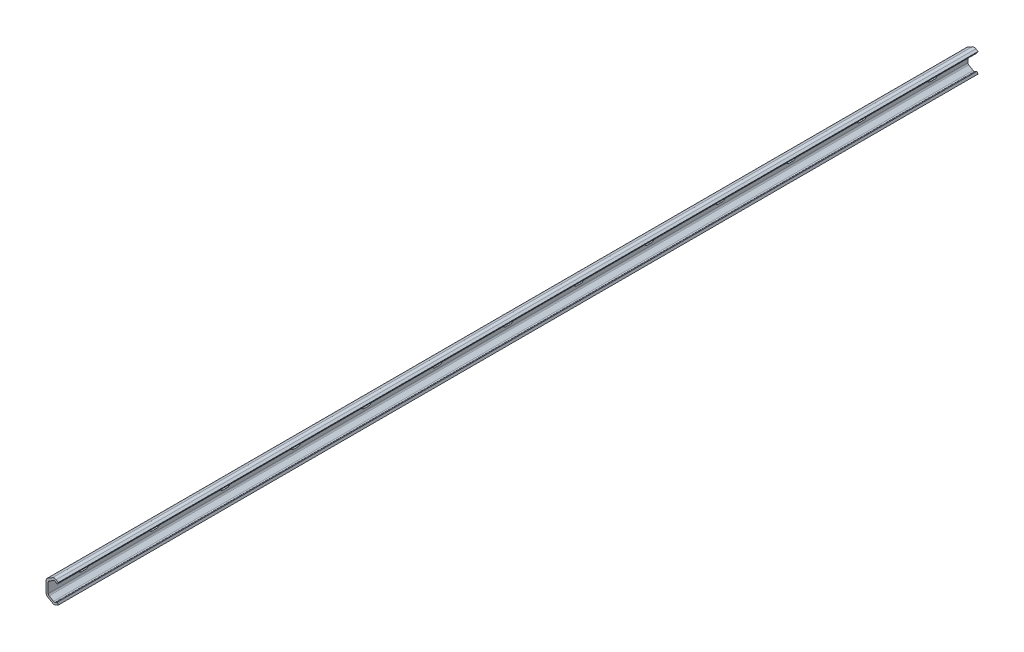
ISO-10303-21;
HEADER;
FILE_DESCRIPTION(('STEP AP214'),'2;1');
FILE_NAME('part.step','',(''),(''),'','','');
FILE_SCHEMA(('AUTOMOTIVE_DESIGN { 1 0 10303 214 1 1 1 1 }'));
ENDSEC;
DATA;
#1=APPLICATION_CONTEXT('core data for automotive mechanical design processes');
#2=APPLICATION_PROTOCOL_DEFINITION('international standard','automotive_design',2000,#1);
#3=PRODUCT_CONTEXT('',#1,'mechanical');
#4=PRODUCT('Part','Part','',(#3));
#5=PRODUCT_RELATED_PRODUCT_CATEGORY('part','',(#4));
#6=PRODUCT_DEFINITION_FORMATION('','',#4);
#7=PRODUCT_DEFINITION_CONTEXT('part definition',#1,'design');
#8=PRODUCT_DEFINITION('design','',#6,#7);
#9=PRODUCT_DEFINITION_SHAPE('','',#8);
#10=(LENGTH_UNIT() NAMED_UNIT(*) SI_UNIT(.MILLI.,.METRE.));
#11=(NAMED_UNIT(*) PLANE_ANGLE_UNIT() SI_UNIT($,.RADIAN.));
#12=(NAMED_UNIT(*) SI_UNIT($,.STERADIAN.) SOLID_ANGLE_UNIT());
#13=UNCERTAINTY_MEASURE_WITH_UNIT(LENGTH_MEASURE(1.E-05),#10,'distance_accuracy_value','');
#14=(GEOMETRIC_REPRESENTATION_CONTEXT(3) GLOBAL_UNCERTAINTY_ASSIGNED_CONTEXT((#13)) GLOBAL_UNIT_ASSIGNED_CONTEXT((#10,
#11,#12)) REPRESENTATION_CONTEXT('',''));
#15=CARTESIAN_POINT('',(0.,0.,0.));
#16=DIRECTION('',(0.,0.,1.));
#17=DIRECTION('',(1.,0.,0.));
#18=AXIS2_PLACEMENT_3D('',#15,#16,#17);
#19=CARTESIAN_POINT('',(0.,-3.,-997.5));
#20=DIRECTION('',(0.,-1.,0.));
#21=DIRECTION('',(0.,0.,-1.));
#22=AXIS2_PLACEMENT_3D('',#19,#20,#21);
#23=PLANE('',#22);
#24=DIRECTION('',(0.,0.,-1.));
#25=VECTOR('',#24,1.);
#26=CARTESIAN_POINT('',(2.500179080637,-3.,-997.5));
#27=LINE('',#26,#25);
#28=CARTESIAN_POINT('',(2.500179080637,-3.,-997.5));
#29=VERTEX_POINT('',#28);
#30=CARTESIAN_POINT('',(2.500179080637,-3.,-1002.5));
#31=VERTEX_POINT('',#30);
#32=EDGE_CURVE('E1256',#29,#31,#27,.T.);
#33=ORIENTED_EDGE('',*,*,#32,.T.);
#34=DIRECTION('',(1.,0.,0.));
#35=VECTOR('',#34,1.);
#36=CARTESIAN_POINT('',(0.,-3.,-1002.5));
#37=LINE('',#36,#35);
#38=CARTESIAN_POINT('',(0.,-3.,-1002.5));
#39=VERTEX_POINT('',#38);
#40=EDGE_CURVE('E11',#39,#31,#37,.T.);
#41=ORIENTED_EDGE('',*,*,#40,.F.);
#42=DIRECTION('',(0.,0.,-1.));
#43=VECTOR('',#42,1.);
#44=CARTESIAN_POINT('',(0.,-3.,-997.5));
#45=LINE('',#44,#43);
#46=CARTESIAN_POINT('',(0.,-3.,-997.5));
#47=VERTEX_POINT('',#46);
#48=EDGE_CURVE('E1262',#47,#39,#45,.T.);
#49=ORIENTED_EDGE('',*,*,#48,.F.);
#50=DIRECTION('',(1.,0.,0.));
#51=VECTOR('',#50,1.);
#52=CARTESIAN_POINT('',(0.,-3.,-997.5));
#53=LINE('',#52,#51);
#54=EDGE_CURVE('E1270',#47,#29,#53,.T.);
#55=ORIENTED_EDGE('',*,*,#54,.T.);
#56=EDGE_LOOP('',(#33,#41,#49,#55));
#57=FACE_BOUND('',#56,.T.);
#58=ADVANCED_FACE('F39',(#57),#23,.F.);
#59=CARTESIAN_POINT('',(0.,0.,-1002.5));
#60=DIRECTION('',(1.,0.,0.));
#61=DIRECTION('',(0.,0.,-1.));
#62=AXIS2_PLACEMENT_3D('',#59,#60,#61);
#63=CYLINDRICAL_SURFACE('',#62,3.);
#64=CARTESIAN_POINT('',(2.500179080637,0.,-1002.5));
#65=DIRECTION('',(1.,0.,0.));
#66=DIRECTION('',(0.,0.,-1.));
#67=AXIS2_PLACEMENT_3D('',#64,#65,#66);
#68=CIRCLE('',#67,3.);
#69=CARTESIAN_POINT('',(2.500179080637,3.,-1002.5));
#70=VERTEX_POINT('',#69);
#71=EDGE_CURVE('E1253',#31,#70,#68,.T.);
#72=ORIENTED_EDGE('',*,*,#71,.T.);
#73=DIRECTION('',(1.,0.,0.));
#74=VECTOR('',#73,1.);
#75=CARTESIAN_POINT('',(0.,3.,-1002.5));
#76=LINE('',#75,#74);
#77=CARTESIAN_POINT('',(0.,3.,-1002.5));
#78=VERTEX_POINT('',#77);
#79=EDGE_CURVE('E47',#78,#70,#76,.T.);
#80=ORIENTED_EDGE('',*,*,#79,.F.);
#81=CARTESIAN_POINT('',(0.,0.,-1002.5));
#82=DIRECTION('',(1.,0.,0.));
#83=DIRECTION('',(0.,0.,-1.));
#84=AXIS2_PLACEMENT_3D('',#81,#82,#83);
#85=CIRCLE('',#84,3.);
#86=EDGE_CURVE('E61',#39,#78,#85,.T.);
#87=ORIENTED_EDGE('',*,*,#86,.F.);
#88=ORIENTED_EDGE('',*,*,#40,.T.);
#89=EDGE_LOOP('',(#72,#80,#87,#88));
#90=FACE_BOUND('',#89,.T.);
#91=ADVANCED_FACE('F1283',(#90),#63,.F.);
#92=CARTESIAN_POINT('',(0.,3.,-997.5));
#93=DIRECTION('',(0.,1.,0.));
#94=DIRECTION('',(0.,0.,1.));
#95=AXIS2_PLACEMENT_3D('',#92,#93,#94);
#96=PLANE('',#95);
#97=DIRECTION('',(0.,0.,1.));
#98=VECTOR('',#97,1.);
#99=CARTESIAN_POINT('',(2.500179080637,3.,-997.5));
#100=LINE('',#99,#98);
#101=CARTESIAN_POINT('',(2.500179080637,3.,-997.5));
#102=VERTEX_POINT('',#101);
#103=EDGE_CURVE('E1249',#70,#102,#100,.T.);
#104=ORIENTED_EDGE('',*,*,#103,.T.);
#105=DIRECTION('',(1.,0.,0.));
#106=VECTOR('',#105,1.);
#107=CARTESIAN_POINT('',(0.,3.,-997.5));
#108=LINE('',#107,#106);
#109=CARTESIAN_POINT('',(0.,3.,-997.5));
#110=VERTEX_POINT('',#109);
#111=EDGE_CURVE('E1274',#110,#102,#108,.T.);
#112=ORIENTED_EDGE('',*,*,#111,.F.);
#113=DIRECTION('',(0.,0.,1.));
#114=VECTOR('',#113,1.);
#115=CARTESIAN_POINT('',(0.,3.,-997.5));
#116=LINE('',#115,#114);
#117=EDGE_CURVE('E1267',#78,#110,#116,.T.);
#118=ORIENTED_EDGE('',*,*,#117,.F.);
#119=ORIENTED_EDGE('',*,*,#79,.T.);
#120=EDGE_LOOP('',(#104,#112,#118,#119));
#121=FACE_BOUND('',#120,.T.);
#122=ADVANCED_FACE('F1280',(#121),#96,.F.);
#123=CARTESIAN_POINT('',(0.,0.,-997.5));
#124=DIRECTION('',(1.,0.,0.));
#125=DIRECTION('',(0.,0.,-1.));
#126=AXIS2_PLACEMENT_3D('',#123,#124,#125);
#127=CYLINDRICAL_SURFACE('',#126,3.);
#128=CARTESIAN_POINT('',(2.500179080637,0.,-997.5));
#129=DIRECTION('',(1.,0.,0.));
#130=DIRECTION('',(0.,0.,-1.));
#131=AXIS2_PLACEMENT_3D('',#128,#129,#130);
#132=CIRCLE('',#131,3.);
#133=EDGE_CURVE('E1246',#102,#29,#132,.T.);
#134=ORIENTED_EDGE('',*,*,#133,.T.);
#135=ORIENTED_EDGE('',*,*,#54,.F.);
#136=CARTESIAN_POINT('',(0.,0.,-997.5));
#137=DIRECTION('',(1.,0.,0.));
#138=DIRECTION('',(0.,0.,-1.));
#139=AXIS2_PLACEMENT_3D('',#136,#137,#138);
#140=CIRCLE('',#139,3.);
#141=EDGE_CURVE('E54',#110,#47,#140,.T.);
#142=ORIENTED_EDGE('',*,*,#141,.F.);
#143=ORIENTED_EDGE('',*,*,#111,.T.);
#144=EDGE_LOOP('',(#134,#135,#142,#143));
#145=FACE_BOUND('',#144,.T.);
#146=ADVANCED_FACE('F1289',(#145),#127,.F.);
#147=CARTESIAN_POINT('',(0.,-3.,-917.5));
#148=DIRECTION('',(0.,-1.,0.));
#149=DIRECTION('',(0.,0.,-1.));
#150=AXIS2_PLACEMENT_3D('',#147,#148,#149);
#151=PLANE('',#150);
#152=DIRECTION('',(0.,0.,-1.));
#153=VECTOR('',#152,1.);
#154=CARTESIAN_POINT('',(2.500179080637,-3.,-917.5));
#155=LINE('',#154,#153);
#156=CARTESIAN_POINT('',(2.500179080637,-3.,-917.5));
#157=VERTEX_POINT('',#156);
#158=CARTESIAN_POINT('',(2.500179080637,-3.,-922.5));
#159=VERTEX_POINT('',#158);
#160=EDGE_CURVE('E1213',#157,#159,#155,.T.);
#161=ORIENTED_EDGE('',*,*,#160,.T.);
#162=DIRECTION('',(1.,0.,0.));
#163=VECTOR('',#162,1.);
#164=CARTESIAN_POINT('',(0.,-3.,-922.5));
#165=LINE('',#164,#163);
#166=CARTESIAN_POINT('',(0.,-3.,-922.5));
#167=VERTEX_POINT('',#166);
#168=EDGE_CURVE('E1242',#167,#159,#165,.T.);
#169=ORIENTED_EDGE('',*,*,#168,.F.);
#170=DIRECTION('',(0.,0.,-1.));
#171=VECTOR('',#170,1.);
#172=CARTESIAN_POINT('',(0.,-3.,-917.5));
#173=LINE('',#172,#171);
#174=CARTESIAN_POINT('',(0.,-3.,-917.5));
#175=VERTEX_POINT('',#174);
#176=EDGE_CURVE('E1220',#175,#167,#173,.T.);
#177=ORIENTED_EDGE('',*,*,#176,.F.);
#178=DIRECTION('',(1.,0.,0.));
#179=VECTOR('',#178,1.);
#180=CARTESIAN_POINT('',(0.,-3.,-917.5));
#181=LINE('',#180,#179);
#182=EDGE_CURVE('E1230',#175,#157,#181,.T.);
#183=ORIENTED_EDGE('',*,*,#182,.T.);
#184=EDGE_LOOP('',(#161,#169,#177,#183));
#185=FACE_BOUND('',#184,.T.);
#186=ADVANCED_FACE('F1291',(#185),#151,.F.);
#187=CARTESIAN_POINT('',(0.,0.,-922.5));
#188=DIRECTION('',(1.,0.,0.));
#189=DIRECTION('',(0.,0.,-1.));
#190=AXIS2_PLACEMENT_3D('',#187,#188,#189);
#191=CYLINDRICAL_SURFACE('',#190,3.);
#192=CARTESIAN_POINT('',(2.500179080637,0.,-922.5));
#193=DIRECTION('',(1.,0.,0.));
#194=DIRECTION('',(0.,0.,-1.));
#195=AXIS2_PLACEMENT_3D('',#192,#193,#194);
#196=CIRCLE('',#195,3.);
#197=CARTESIAN_POINT('',(2.500179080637,3.,-922.5));
#198=VERTEX_POINT('',#197);
#199=EDGE_CURVE('E1209',#159,#198,#196,.T.);
#200=ORIENTED_EDGE('',*,*,#199,.T.);
#201=DIRECTION('',(1.,0.,0.));
#202=VECTOR('',#201,1.);
#203=CARTESIAN_POINT('',(0.,3.,-922.5));
#204=LINE('',#203,#202);
#205=CARTESIAN_POINT('',(0.,3.,-922.5));
#206=VERTEX_POINT('',#205);
#207=EDGE_CURVE('E1238',#206,#198,#204,.T.);
#208=ORIENTED_EDGE('',*,*,#207,.F.);
#209=CARTESIAN_POINT('',(0.,0.,-922.5));
#210=DIRECTION('',(1.,0.,0.));
#211=DIRECTION('',(0.,0.,-1.));
#212=AXIS2_PLACEMENT_3D('',#209,#210,#211);
#213=CIRCLE('',#212,3.);
#214=EDGE_CURVE('E1223',#167,#206,#213,.T.);
#215=ORIENTED_EDGE('',*,*,#214,.F.);
#216=ORIENTED_EDGE('',*,*,#168,.T.);
#217=EDGE_LOOP('',(#200,#208,#215,#216));
#218=FACE_BOUND('',#217,.T.);
#219=ADVANCED_FACE('F1297',(#218),#191,.F.);
#220=CARTESIAN_POINT('',(0.,3.,-917.5));
#221=DIRECTION('',(0.,1.,0.));
#222=DIRECTION('',(0.,0.,1.));
#223=AXIS2_PLACEMENT_3D('',#220,#221,#222);
#224=PLANE('',#223);
#225=DIRECTION('',(0.,0.,1.));
#226=VECTOR('',#225,1.);
#227=CARTESIAN_POINT('',(2.500179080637,3.,-917.5));
#228=LINE('',#227,#226);
#229=CARTESIAN_POINT('',(2.500179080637,3.,-917.5));
#230=VERTEX_POINT('',#229);
#231=EDGE_CURVE('E1205',#198,#230,#228,.T.);
#232=ORIENTED_EDGE('',*,*,#231,.T.);
#233=DIRECTION('',(1.,0.,0.));
#234=VECTOR('',#233,1.);
#235=CARTESIAN_POINT('',(0.,3.,-917.5));
#236=LINE('',#235,#234);
#237=CARTESIAN_POINT('',(0.,3.,-917.5));
#238=VERTEX_POINT('',#237);
#239=EDGE_CURVE('E1234',#238,#230,#236,.T.);
#240=ORIENTED_EDGE('',*,*,#239,.F.);
#241=DIRECTION('',(0.,0.,1.));
#242=VECTOR('',#241,1.);
#243=CARTESIAN_POINT('',(0.,3.,-917.5));
#244=LINE('',#243,#242);
#245=EDGE_CURVE('E1226',#206,#238,#244,.T.);
#246=ORIENTED_EDGE('',*,*,#245,.F.);
#247=ORIENTED_EDGE('',*,*,#207,.T.);
#248=EDGE_LOOP('',(#232,#240,#246,#247));
#249=FACE_BOUND('',#248,.T.);
#250=ADVANCED_FACE('F1325',(#249),#224,.F.);
#251=CARTESIAN_POINT('',(0.,0.,-917.5));
#252=DIRECTION('',(1.,0.,0.));
#253=DIRECTION('',(0.,0.,-1.));
#254=AXIS2_PLACEMENT_3D('',#251,#252,#253);
#255=CYLINDRICAL_SURFACE('',#254,3.);
#256=CARTESIAN_POINT('',(2.500179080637,0.,-917.5));
#257=DIRECTION('',(1.,0.,0.));
#258=DIRECTION('',(0.,0.,-1.));
#259=AXIS2_PLACEMENT_3D('',#256,#257,#258);
#260=CIRCLE('',#259,3.);
#261=EDGE_CURVE('E1202',#230,#157,#260,.T.);
#262=ORIENTED_EDGE('',*,*,#261,.T.);
#263=ORIENTED_EDGE('',*,*,#182,.F.);
#264=CARTESIAN_POINT('',(0.,0.,-917.5));
#265=DIRECTION('',(1.,0.,0.));
#266=DIRECTION('',(0.,0.,-1.));
#267=AXIS2_PLACEMENT_3D('',#264,#265,#266);
#268=CIRCLE('',#267,3.);
#269=EDGE_CURVE('E1217',#238,#175,#268,.T.);
#270=ORIENTED_EDGE('',*,*,#269,.F.);
#271=ORIENTED_EDGE('',*,*,#239,.T.);
#272=EDGE_LOOP('',(#262,#263,#270,#271));
#273=FACE_BOUND('',#272,.T.);
#274=ADVANCED_FACE('F1334',(#273),#255,.F.);
#275=CARTESIAN_POINT('',(0.,-3.,-837.5));
#276=DIRECTION('',(0.,-1.,0.));
#277=DIRECTION('',(0.,0.,-1.));
#278=AXIS2_PLACEMENT_3D('',#275,#276,#277);
#279=PLANE('',#278);
#280=DIRECTION('',(0.,0.,-1.));
#281=VECTOR('',#280,1.);
#282=CARTESIAN_POINT('',(2.500179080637,-3.,-837.5));
#283=LINE('',#282,#281);
#284=CARTESIAN_POINT('',(2.500179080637,-3.,-837.5));
#285=VERTEX_POINT('',#284);
#286=CARTESIAN_POINT('',(2.500179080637,-3.,-842.5));
#287=VERTEX_POINT('',#286);
#288=EDGE_CURVE('E1169',#285,#287,#283,.T.);
#289=ORIENTED_EDGE('',*,*,#288,.T.);
#290=DIRECTION('',(1.,0.,0.));
#291=VECTOR('',#290,1.);
#292=CARTESIAN_POINT('',(0.,-3.,-842.5));
#293=LINE('',#292,#291);
#294=CARTESIAN_POINT('',(0.,-3.,-842.5));
#295=VERTEX_POINT('',#294);
#296=EDGE_CURVE('E1198',#295,#287,#293,.T.);
#297=ORIENTED_EDGE('',*,*,#296,.F.);
#298=DIRECTION('',(0.,0.,-1.));
#299=VECTOR('',#298,1.);
#300=CARTESIAN_POINT('',(0.,-3.,-837.5));
#301=LINE('',#300,#299);
#302=CARTESIAN_POINT('',(0.,-3.,-837.5));
#303=VERTEX_POINT('',#302);
#304=EDGE_CURVE('E1176',#303,#295,#301,.T.);
#305=ORIENTED_EDGE('',*,*,#304,.F.);
#306=DIRECTION('',(1.,0.,0.));
#307=VECTOR('',#306,1.);
#308=CARTESIAN_POINT('',(0.,-3.,-837.5));
#309=LINE('',#308,#307);
#310=EDGE_CURVE('E1186',#303,#285,#309,.T.);
#311=ORIENTED_EDGE('',*,*,#310,.T.);
#312=EDGE_LOOP('',(#289,#297,#305,#311));
#313=FACE_BOUND('',#312,.T.);
#314=ADVANCED_FACE('F1343',(#313),#279,.F.);
#315=CARTESIAN_POINT('',(0.,0.,-842.5));
#316=DIRECTION('',(1.,0.,0.));
#317=DIRECTION('',(0.,0.,-1.));
#318=AXIS2_PLACEMENT_3D('',#315,#316,#317);
#319=CYLINDRICAL_SURFACE('',#318,3.);
#320=CARTESIAN_POINT('',(2.500179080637,0.,-842.5));
#321=DIRECTION('',(1.,0.,0.));
#322=DIRECTION('',(0.,0.,-1.));
#323=AXIS2_PLACEMENT_3D('',#320,#321,#322);
#324=CIRCLE('',#323,3.);
#325=CARTESIAN_POINT('',(2.500179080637,3.,-842.5));
#326=VERTEX_POINT('',#325);
#327=EDGE_CURVE('E1165',#287,#326,#324,.T.);
#328=ORIENTED_EDGE('',*,*,#327,.T.);
#329=DIRECTION('',(1.,0.,0.));
#330=VECTOR('',#329,1.);
#331=CARTESIAN_POINT('',(0.,3.,-842.5));
#332=LINE('',#331,#330);
#333=CARTESIAN_POINT('',(0.,3.,-842.5));
#334=VERTEX_POINT('',#333);
#335=EDGE_CURVE('E1194',#334,#326,#332,.T.);
#336=ORIENTED_EDGE('',*,*,#335,.F.);
#337=CARTESIAN_POINT('',(0.,0.,-842.5));
#338=DIRECTION('',(1.,0.,0.));
#339=DIRECTION('',(0.,0.,-1.));
#340=AXIS2_PLACEMENT_3D('',#337,#338,#339);
#341=CIRCLE('',#340,3.);
#342=EDGE_CURVE('E1179',#295,#334,#341,.T.);
#343=ORIENTED_EDGE('',*,*,#342,.F.);
#344=ORIENTED_EDGE('',*,*,#296,.T.);
#345=EDGE_LOOP('',(#328,#336,#343,#344));
#346=FACE_BOUND('',#345,.T.);
#347=ADVANCED_FACE('F1352',(#346),#319,.F.);
#348=CARTESIAN_POINT('',(0.,3.,-837.5));
#349=DIRECTION('',(0.,1.,0.));
#350=DIRECTION('',(0.,0.,1.));
#351=AXIS2_PLACEMENT_3D('',#348,#349,#350);
#352=PLANE('',#351);
#353=DIRECTION('',(0.,0.,1.));
#354=VECTOR('',#353,1.);
#355=CARTESIAN_POINT('',(2.500179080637,3.,-837.5));
#356=LINE('',#355,#354);
#357=CARTESIAN_POINT('',(2.500179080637,3.,-837.5));
#358=VERTEX_POINT('',#357);
#359=EDGE_CURVE('E1161',#326,#358,#356,.T.);
#360=ORIENTED_EDGE('',*,*,#359,.T.);
#361=DIRECTION('',(1.,0.,0.));
#362=VECTOR('',#361,1.);
#363=CARTESIAN_POINT('',(0.,3.,-837.5));
#364=LINE('',#363,#362);
#365=CARTESIAN_POINT('',(0.,3.,-837.5));
#366=VERTEX_POINT('',#365);
#367=EDGE_CURVE('E1190',#366,#358,#364,.T.);
#368=ORIENTED_EDGE('',*,*,#367,.F.);
#369=DIRECTION('',(0.,0.,1.));
#370=VECTOR('',#369,1.);
#371=CARTESIAN_POINT('',(0.,3.,-837.5));
#372=LINE('',#371,#370);
#373=EDGE_CURVE('E1182',#334,#366,#372,.T.);
#374=ORIENTED_EDGE('',*,*,#373,.F.);
#375=ORIENTED_EDGE('',*,*,#335,.T.);
#376=EDGE_LOOP('',(#360,#368,#374,#375));
#377=FACE_BOUND('',#376,.T.);
#378=ADVANCED_FACE('F1361',(#377),#352,.F.);
#379=CARTESIAN_POINT('',(0.,0.,-837.5));
#380=DIRECTION('',(1.,0.,0.));
#381=DIRECTION('',(0.,0.,-1.));
#382=AXIS2_PLACEMENT_3D('',#379,#380,#381);
#383=CYLINDRICAL_SURFACE('',#382,3.);
#384=CARTESIAN_POINT('',(2.500179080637,0.,-837.5));
#385=DIRECTION('',(1.,0.,0.));
#386=DIRECTION('',(0.,0.,-1.));
#387=AXIS2_PLACEMENT_3D('',#384,#385,#386);
#388=CIRCLE('',#387,3.);
#389=EDGE_CURVE('E1158',#358,#285,#388,.T.);
#390=ORIENTED_EDGE('',*,*,#389,.T.);
#391=ORIENTED_EDGE('',*,*,#310,.F.);
#392=CARTESIAN_POINT('',(0.,0.,-837.5));
#393=DIRECTION('',(1.,0.,0.));
#394=DIRECTION('',(0.,0.,-1.));
#395=AXIS2_PLACEMENT_3D('',#392,#393,#394);
#396=CIRCLE('',#395,3.);
#397=EDGE_CURVE('E1173',#366,#303,#396,.T.);
#398=ORIENTED_EDGE('',*,*,#397,.F.);
#399=ORIENTED_EDGE('',*,*,#367,.T.);
#400=EDGE_LOOP('',(#390,#391,#398,#399));
#401=FACE_BOUND('',#400,.T.);
#402=ADVANCED_FACE('F1370',(#401),#383,.F.);
#403=CARTESIAN_POINT('',(0.,-3.,-757.5));
#404=DIRECTION('',(0.,-1.,0.));
#405=DIRECTION('',(0.,0.,-1.));
#406=AXIS2_PLACEMENT_3D('',#403,#404,#405);
#407=PLANE('',#406);
#408=DIRECTION('',(0.,0.,-1.));
#409=VECTOR('',#408,1.);
#410=CARTESIAN_POINT('',(2.500179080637,-3.,-757.5));
#411=LINE('',#410,#409);
#412=CARTESIAN_POINT('',(2.500179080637,-3.,-757.5));
#413=VERTEX_POINT('',#412);
#414=CARTESIAN_POINT('',(2.500179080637,-3.,-762.5));
#415=VERTEX_POINT('',#414);
#416=EDGE_CURVE('E1125',#413,#415,#411,.T.);
#417=ORIENTED_EDGE('',*,*,#416,.T.);
#418=DIRECTION('',(1.,0.,0.));
#419=VECTOR('',#418,1.);
#420=CARTESIAN_POINT('',(0.,-3.,-762.5));
#421=LINE('',#420,#419);
#422=CARTESIAN_POINT('',(0.,-3.,-762.5));
#423=VERTEX_POINT('',#422);
#424=EDGE_CURVE('E1154',#423,#415,#421,.T.);
#425=ORIENTED_EDGE('',*,*,#424,.F.);
#426=DIRECTION('',(0.,0.,-1.));
#427=VECTOR('',#426,1.);
#428=CARTESIAN_POINT('',(0.,-3.,-757.5));
#429=LINE('',#428,#427);
#430=CARTESIAN_POINT('',(0.,-3.,-757.5));
#431=VERTEX_POINT('',#430);
#432=EDGE_CURVE('E1132',#431,#423,#429,.T.);
#433=ORIENTED_EDGE('',*,*,#432,.F.);
#434=DIRECTION('',(1.,0.,0.));
#435=VECTOR('',#434,1.);
#436=CARTESIAN_POINT('',(0.,-3.,-757.5));
#437=LINE('',#436,#435);
#438=EDGE_CURVE('E1142',#431,#413,#437,.T.);
#439=ORIENTED_EDGE('',*,*,#438,.T.);
#440=EDGE_LOOP('',(#417,#425,#433,#439));
#441=FACE_BOUND('',#440,.T.);
#442=ADVANCED_FACE('F1379',(#441),#407,.F.);
#443=CARTESIAN_POINT('',(0.,0.,-762.5));
#444=DIRECTION('',(1.,0.,0.));
#445=DIRECTION('',(0.,0.,-1.));
#446=AXIS2_PLACEMENT_3D('',#443,#444,#445);
#447=CYLINDRICAL_SURFACE('',#446,3.);
#448=CARTESIAN_POINT('',(2.500179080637,0.,-762.5));
#449=DIRECTION('',(1.,0.,0.));
#450=DIRECTION('',(0.,0.,-1.));
#451=AXIS2_PLACEMENT_3D('',#448,#449,#450);
#452=CIRCLE('',#451,3.);
#453=CARTESIAN_POINT('',(2.500179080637,3.,-762.5));
#454=VERTEX_POINT('',#453);
#455=EDGE_CURVE('E1121',#415,#454,#452,.T.);
#456=ORIENTED_EDGE('',*,*,#455,.T.);
#457=DIRECTION('',(1.,0.,0.));
#458=VECTOR('',#457,1.);
#459=CARTESIAN_POINT('',(0.,3.,-762.5));
#460=LINE('',#459,#458);
#461=CARTESIAN_POINT('',(0.,3.,-762.5));
#462=VERTEX_POINT('',#461);
#463=EDGE_CURVE('E1150',#462,#454,#460,.T.);
#464=ORIENTED_EDGE('',*,*,#463,.F.);
#465=CARTESIAN_POINT('',(0.,0.,-762.5));
#466=DIRECTION('',(1.,0.,0.));
#467=DIRECTION('',(0.,0.,-1.));
#468=AXIS2_PLACEMENT_3D('',#465,#466,#467);
#469=CIRCLE('',#468,3.);
#470=EDGE_CURVE('E1135',#423,#462,#469,.T.);
#471=ORIENTED_EDGE('',*,*,#470,.F.);
#472=ORIENTED_EDGE('',*,*,#424,.T.);
#473=EDGE_LOOP('',(#456,#464,#471,#472));
#474=FACE_BOUND('',#473,.T.);
#475=ADVANCED_FACE('F1388',(#474),#447,.F.);
#476=CARTESIAN_POINT('',(0.,3.,-757.5));
#477=DIRECTION('',(0.,1.,0.));
#478=DIRECTION('',(0.,0.,1.));
#479=AXIS2_PLACEMENT_3D('',#476,#477,#478);
#480=PLANE('',#479);
#481=DIRECTION('',(0.,0.,1.));
#482=VECTOR('',#481,1.);
#483=CARTESIAN_POINT('',(2.500179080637,3.,-757.5));
#484=LINE('',#483,#482);
#485=CARTESIAN_POINT('',(2.500179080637,3.,-757.5));
#486=VERTEX_POINT('',#485);
#487=EDGE_CURVE('E1117',#454,#486,#484,.T.);
#488=ORIENTED_EDGE('',*,*,#487,.T.);
#489=DIRECTION('',(1.,0.,0.));
#490=VECTOR('',#489,1.);
#491=CARTESIAN_POINT('',(0.,3.,-757.5));
#492=LINE('',#491,#490);
#493=CARTESIAN_POINT('',(0.,3.,-757.5));
#494=VERTEX_POINT('',#493);
#495=EDGE_CURVE('E1146',#494,#486,#492,.T.);
#496=ORIENTED_EDGE('',*,*,#495,.F.);
#497=DIRECTION('',(0.,0.,1.));
#498=VECTOR('',#497,1.);
#499=CARTESIAN_POINT('',(0.,3.,-757.5));
#500=LINE('',#499,#498);
#501=EDGE_CURVE('E1138',#462,#494,#500,.T.);
#502=ORIENTED_EDGE('',*,*,#501,.F.);
#503=ORIENTED_EDGE('',*,*,#463,.T.);
#504=EDGE_LOOP('',(#488,#496,#502,#503));
#505=FACE_BOUND('',#504,.T.);
#506=ADVANCED_FACE('F1397',(#505),#480,.F.);
#507=CARTESIAN_POINT('',(0.,0.,-757.5));
#508=DIRECTION('',(1.,0.,0.));
#509=DIRECTION('',(0.,0.,-1.));
#510=AXIS2_PLACEMENT_3D('',#507,#508,#509);
#511=CYLINDRICAL_SURFACE('',#510,3.);
#512=CARTESIAN_POINT('',(2.500179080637,0.,-757.5));
#513=DIRECTION('',(1.,0.,0.));
#514=DIRECTION('',(0.,0.,-1.));
#515=AXIS2_PLACEMENT_3D('',#512,#513,#514);
#516=CIRCLE('',#515,3.);
#517=EDGE_CURVE('E1114',#486,#413,#516,.T.);
#518=ORIENTED_EDGE('',*,*,#517,.T.);
#519=ORIENTED_EDGE('',*,*,#438,.F.);
#520=CARTESIAN_POINT('',(0.,0.,-757.5));
#521=DIRECTION('',(1.,0.,0.));
#522=DIRECTION('',(0.,0.,-1.));
#523=AXIS2_PLACEMENT_3D('',#520,#521,#522);
#524=CIRCLE('',#523,3.);
#525=EDGE_CURVE('E1129',#494,#431,#524,.T.);
#526=ORIENTED_EDGE('',*,*,#525,.F.);
#527=ORIENTED_EDGE('',*,*,#495,.T.);
#528=EDGE_LOOP('',(#518,#519,#526,#527));
#529=FACE_BOUND('',#528,.T.);
#530=ADVANCED_FACE('F1406',(#529),#511,.F.);
#531=CARTESIAN_POINT('',(0.,-3.,-677.5));
#532=DIRECTION('',(0.,-1.,0.));
#533=DIRECTION('',(0.,0.,-1.));
#534=AXIS2_PLACEMENT_3D('',#531,#532,#533);
#535=PLANE('',#534);
#536=DIRECTION('',(0.,0.,-1.));
#537=VECTOR('',#536,1.);
#538=CARTESIAN_POINT('',(2.500179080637,-3.,-677.5));
#539=LINE('',#538,#537);
#540=CARTESIAN_POINT('',(2.500179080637,-3.,-677.5));
#541=VERTEX_POINT('',#540);
#542=CARTESIAN_POINT('',(2.500179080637,-3.,-682.5));
#543=VERTEX_POINT('',#542);
#544=EDGE_CURVE('E1081',#541,#543,#539,.T.);
#545=ORIENTED_EDGE('',*,*,#544,.T.);
#546=DIRECTION('',(1.,0.,0.));
#547=VECTOR('',#546,1.);
#548=CARTESIAN_POINT('',(0.,-3.,-682.5));
#549=LINE('',#548,#547);
#550=CARTESIAN_POINT('',(0.,-3.,-682.5));
#551=VERTEX_POINT('',#550);
#552=EDGE_CURVE('E1110',#551,#543,#549,.T.);
#553=ORIENTED_EDGE('',*,*,#552,.F.);
#554=DIRECTION('',(0.,0.,-1.));
#555=VECTOR('',#554,1.);
#556=CARTESIAN_POINT('',(0.,-3.,-677.5));
#557=LINE('',#556,#555);
#558=CARTESIAN_POINT('',(0.,-3.,-677.5));
#559=VERTEX_POINT('',#558);
#560=EDGE_CURVE('E1088',#559,#551,#557,.T.);
#561=ORIENTED_EDGE('',*,*,#560,.F.);
#562=DIRECTION('',(1.,0.,0.));
#563=VECTOR('',#562,1.);
#564=CARTESIAN_POINT('',(0.,-3.,-677.5));
#565=LINE('',#564,#563);
#566=EDGE_CURVE('E1098',#559,#541,#565,.T.);
#567=ORIENTED_EDGE('',*,*,#566,.T.);
#568=EDGE_LOOP('',(#545,#553,#561,#567));
#569=FACE_BOUND('',#568,.T.);
#570=ADVANCED_FACE('F1415',(#569),#535,.F.);
#571=CARTESIAN_POINT('',(0.,0.,-682.5));
#572=DIRECTION('',(1.,0.,0.));
#573=DIRECTION('',(0.,0.,-1.));
#574=AXIS2_PLACEMENT_3D('',#571,#572,#573);
#575=CYLINDRICAL_SURFACE('',#574,3.);
#576=CARTESIAN_POINT('',(2.500179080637,0.,-682.5));
#577=DIRECTION('',(1.,0.,0.));
#578=DIRECTION('',(0.,0.,-1.));
#579=AXIS2_PLACEMENT_3D('',#576,#577,#578);
#580=CIRCLE('',#579,3.);
#581=CARTESIAN_POINT('',(2.500179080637,3.,-682.5));
#582=VERTEX_POINT('',#581);
#583=EDGE_CURVE('E1077',#543,#582,#580,.T.);
#584=ORIENTED_EDGE('',*,*,#583,.T.);
#585=DIRECTION('',(1.,0.,0.));
#586=VECTOR('',#585,1.);
#587=CARTESIAN_POINT('',(0.,3.,-682.5));
#588=LINE('',#587,#586);
#589=CARTESIAN_POINT('',(0.,3.,-682.5));
#590=VERTEX_POINT('',#589);
#591=EDGE_CURVE('E1106',#590,#582,#588,.T.);
#592=ORIENTED_EDGE('',*,*,#591,.F.);
#593=CARTESIAN_POINT('',(0.,0.,-682.5));
#594=DIRECTION('',(1.,0.,0.));
#595=DIRECTION('',(0.,0.,-1.));
#596=AXIS2_PLACEMENT_3D('',#593,#594,#595);
#597=CIRCLE('',#596,3.);
#598=EDGE_CURVE('E1091',#551,#590,#597,.T.);
#599=ORIENTED_EDGE('',*,*,#598,.F.);
#600=ORIENTED_EDGE('',*,*,#552,.T.);
#601=EDGE_LOOP('',(#584,#592,#599,#600));
#602=FACE_BOUND('',#601,.T.);
#603=ADVANCED_FACE('F1424',(#602),#575,.F.);
#604=CARTESIAN_POINT('',(0.,3.,-677.5));
#605=DIRECTION('',(0.,1.,0.));
#606=DIRECTION('',(0.,0.,1.));
#607=AXIS2_PLACEMENT_3D('',#604,#605,#606);
#608=PLANE('',#607);
#609=DIRECTION('',(0.,0.,1.));
#610=VECTOR('',#609,1.);
#611=CARTESIAN_POINT('',(2.500179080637,3.,-677.5));
#612=LINE('',#611,#610);
#613=CARTESIAN_POINT('',(2.500179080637,3.,-677.5));
#614=VERTEX_POINT('',#613);
#615=EDGE_CURVE('E1073',#582,#614,#612,.T.);
#616=ORIENTED_EDGE('',*,*,#615,.T.);
#617=DIRECTION('',(1.,0.,0.));
#618=VECTOR('',#617,1.);
#619=CARTESIAN_POINT('',(0.,3.,-677.5));
#620=LINE('',#619,#618);
#621=CARTESIAN_POINT('',(0.,3.,-677.5));
#622=VERTEX_POINT('',#621);
#623=EDGE_CURVE('E1102',#622,#614,#620,.T.);
#624=ORIENTED_EDGE('',*,*,#623,.F.);
#625=DIRECTION('',(0.,0.,1.));
#626=VECTOR('',#625,1.);
#627=CARTESIAN_POINT('',(0.,3.,-677.5));
#628=LINE('',#627,#626);
#629=EDGE_CURVE('E1094',#590,#622,#628,.T.);
#630=ORIENTED_EDGE('',*,*,#629,.F.);
#631=ORIENTED_EDGE('',*,*,#591,.T.);
#632=EDGE_LOOP('',(#616,#624,#630,#631));
#633=FACE_BOUND('',#632,.T.);
#634=ADVANCED_FACE('F1433',(#633),#608,.F.);
#635=CARTESIAN_POINT('',(0.,0.,-677.5));
#636=DIRECTION('',(1.,0.,0.));
#637=DIRECTION('',(0.,0.,-1.));
#638=AXIS2_PLACEMENT_3D('',#635,#636,#637);
#639=CYLINDRICAL_SURFACE('',#638,3.);
#640=CARTESIAN_POINT('',(2.500179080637,0.,-677.5));
#641=DIRECTION('',(1.,0.,0.));
#642=DIRECTION('',(0.,0.,-1.));
#643=AXIS2_PLACEMENT_3D('',#640,#641,#642);
#644=CIRCLE('',#643,3.);
#645=EDGE_CURVE('E1070',#614,#541,#644,.T.);
#646=ORIENTED_EDGE('',*,*,#645,.T.);
#647=ORIENTED_EDGE('',*,*,#566,.F.);
#648=CARTESIAN_POINT('',(0.,0.,-677.5));
#649=DIRECTION('',(1.,0.,0.));
#650=DIRECTION('',(0.,0.,-1.));
#651=AXIS2_PLACEMENT_3D('',#648,#649,#650);
#652=CIRCLE('',#651,3.);
#653=EDGE_CURVE('E1085',#622,#559,#652,.T.);
#654=ORIENTED_EDGE('',*,*,#653,.F.);
#655=ORIENTED_EDGE('',*,*,#623,.T.);
#656=EDGE_LOOP('',(#646,#647,#654,#655));
#657=FACE_BOUND('',#656,.T.);
#658=ADVANCED_FACE('F1442',(#657),#639,.F.);
#659=CARTESIAN_POINT('',(0.,-3.,-597.5));
#660=DIRECTION('',(0.,-1.,0.));
#661=DIRECTION('',(0.,0.,-1.));
#662=AXIS2_PLACEMENT_3D('',#659,#660,#661);
#663=PLANE('',#662);
#664=DIRECTION('',(0.,0.,-1.));
#665=VECTOR('',#664,1.);
#666=CARTESIAN_POINT('',(2.500179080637,-3.,-597.5));
#667=LINE('',#666,#665);
#668=CARTESIAN_POINT('',(2.500179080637,-3.,-597.5));
#669=VERTEX_POINT('',#668);
#670=CARTESIAN_POINT('',(2.500179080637,-3.,-602.5));
#671=VERTEX_POINT('',#670);
#672=EDGE_CURVE('E1037',#669,#671,#667,.T.);
#673=ORIENTED_EDGE('',*,*,#672,.T.);
#674=DIRECTION('',(1.,0.,0.));
#675=VECTOR('',#674,1.);
#676=CARTESIAN_POINT('',(0.,-3.,-602.5));
#677=LINE('',#676,#675);
#678=CARTESIAN_POINT('',(0.,-3.,-602.5));
#679=VERTEX_POINT('',#678);
#680=EDGE_CURVE('E1066',#679,#671,#677,.T.);
#681=ORIENTED_EDGE('',*,*,#680,.F.);
#682=DIRECTION('',(0.,0.,-1.));
#683=VECTOR('',#682,1.);
#684=CARTESIAN_POINT('',(0.,-3.,-597.5));
#685=LINE('',#684,#683);
#686=CARTESIAN_POINT('',(0.,-3.,-597.5));
#687=VERTEX_POINT('',#686);
#688=EDGE_CURVE('E1044',#687,#679,#685,.T.);
#689=ORIENTED_EDGE('',*,*,#688,.F.);
#690=DIRECTION('',(1.,0.,0.));
#691=VECTOR('',#690,1.);
#692=CARTESIAN_POINT('',(0.,-3.,-597.5));
#693=LINE('',#692,#691);
#694=EDGE_CURVE('E1054',#687,#669,#693,.T.);
#695=ORIENTED_EDGE('',*,*,#694,.T.);
#696=EDGE_LOOP('',(#673,#681,#689,#695));
#697=FACE_BOUND('',#696,.T.);
#698=ADVANCED_FACE('F1451',(#697),#663,.F.);
#699=CARTESIAN_POINT('',(0.,0.,-602.5));
#700=DIRECTION('',(1.,0.,0.));
#701=DIRECTION('',(0.,0.,-1.));
#702=AXIS2_PLACEMENT_3D('',#699,#700,#701);
#703=CYLINDRICAL_SURFACE('',#702,3.);
#704=CARTESIAN_POINT('',(2.500179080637,0.,-602.5));
#705=DIRECTION('',(1.,0.,0.));
#706=DIRECTION('',(0.,0.,-1.));
#707=AXIS2_PLACEMENT_3D('',#704,#705,#706);
#708=CIRCLE('',#707,3.);
#709=CARTESIAN_POINT('',(2.500179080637,3.,-602.5));
#710=VERTEX_POINT('',#709);
#711=EDGE_CURVE('E1033',#671,#710,#708,.T.);
#712=ORIENTED_EDGE('',*,*,#711,.T.);
#713=DIRECTION('',(1.,0.,0.));
#714=VECTOR('',#713,1.);
#715=CARTESIAN_POINT('',(0.,3.,-602.5));
#716=LINE('',#715,#714);
#717=CARTESIAN_POINT('',(0.,3.,-602.5));
#718=VERTEX_POINT('',#717);
#719=EDGE_CURVE('E1062',#718,#710,#716,.T.);
#720=ORIENTED_EDGE('',*,*,#719,.F.);
#721=CARTESIAN_POINT('',(0.,0.,-602.5));
#722=DIRECTION('',(1.,0.,0.));
#723=DIRECTION('',(0.,0.,-1.));
#724=AXIS2_PLACEMENT_3D('',#721,#722,#723);
#725=CIRCLE('',#724,3.);
#726=EDGE_CURVE('E1047',#679,#718,#725,.T.);
#727=ORIENTED_EDGE('',*,*,#726,.F.);
#728=ORIENTED_EDGE('',*,*,#680,.T.);
#729=EDGE_LOOP('',(#712,#720,#727,#728));
#730=FACE_BOUND('',#729,.T.);
#731=ADVANCED_FACE('F1460',(#730),#703,.F.);
#732=CARTESIAN_POINT('',(0.,3.,-597.5));
#733=DIRECTION('',(0.,1.,0.));
#734=DIRECTION('',(0.,0.,1.));
#735=AXIS2_PLACEMENT_3D('',#732,#733,#734);
#736=PLANE('',#735);
#737=DIRECTION('',(0.,0.,1.));
#738=VECTOR('',#737,1.);
#739=CARTESIAN_POINT('',(2.500179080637,3.,-597.5));
#740=LINE('',#739,#738);
#741=CARTESIAN_POINT('',(2.500179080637,3.,-597.5));
#742=VERTEX_POINT('',#741);
#743=EDGE_CURVE('E1029',#710,#742,#740,.T.);
#744=ORIENTED_EDGE('',*,*,#743,.T.);
#745=DIRECTION('',(1.,0.,0.));
#746=VECTOR('',#745,1.);
#747=CARTESIAN_POINT('',(0.,3.,-597.5));
#748=LINE('',#747,#746);
#749=CARTESIAN_POINT('',(0.,3.,-597.5));
#750=VERTEX_POINT('',#749);
#751=EDGE_CURVE('E1058',#750,#742,#748,.T.);
#752=ORIENTED_EDGE('',*,*,#751,.F.);
#753=DIRECTION('',(0.,0.,1.));
#754=VECTOR('',#753,1.);
#755=CARTESIAN_POINT('',(0.,3.,-597.5));
#756=LINE('',#755,#754);
#757=EDGE_CURVE('E1050',#718,#750,#756,.T.);
#758=ORIENTED_EDGE('',*,*,#757,.F.);
#759=ORIENTED_EDGE('',*,*,#719,.T.);
#760=EDGE_LOOP('',(#744,#752,#758,#759));
#761=FACE_BOUND('',#760,.T.);
#762=ADVANCED_FACE('F1469',(#761),#736,.F.);
#763=CARTESIAN_POINT('',(0.,0.,-597.5));
#764=DIRECTION('',(1.,0.,0.));
#765=DIRECTION('',(0.,0.,-1.));
#766=AXIS2_PLACEMENT_3D('',#763,#764,#765);
#767=CYLINDRICAL_SURFACE('',#766,3.);
#768=CARTESIAN_POINT('',(2.500179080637,0.,-597.5));
#769=DIRECTION('',(1.,0.,0.));
#770=DIRECTION('',(0.,0.,-1.));
#771=AXIS2_PLACEMENT_3D('',#768,#769,#770);
#772=CIRCLE('',#771,3.);
#773=EDGE_CURVE('E1026',#742,#669,#772,.T.);
#774=ORIENTED_EDGE('',*,*,#773,.T.);
#775=ORIENTED_EDGE('',*,*,#694,.F.);
#776=CARTESIAN_POINT('',(0.,0.,-597.5));
#777=DIRECTION('',(1.,0.,0.));
#778=DIRECTION('',(0.,0.,-1.));
#779=AXIS2_PLACEMENT_3D('',#776,#777,#778);
#780=CIRCLE('',#779,3.);
#781=EDGE_CURVE('E1041',#750,#687,#780,.T.);
#782=ORIENTED_EDGE('',*,*,#781,.F.);
#783=ORIENTED_EDGE('',*,*,#751,.T.);
#784=EDGE_LOOP('',(#774,#775,#782,#783));
#785=FACE_BOUND('',#784,.T.);
#786=ADVANCED_FACE('F1478',(#785),#767,.F.);
#787=CARTESIAN_POINT('',(0.,-3.,-517.5));
#788=DIRECTION('',(0.,-1.,0.));
#789=DIRECTION('',(0.,0.,-1.));
#790=AXIS2_PLACEMENT_3D('',#787,#788,#789);
#791=PLANE('',#790);
#792=DIRECTION('',(0.,0.,-1.));
#793=VECTOR('',#792,1.);
#794=CARTESIAN_POINT('',(2.500179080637,-3.,-517.5));
#795=LINE('',#794,#793);
#796=CARTESIAN_POINT('',(2.500179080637,-3.,-517.5));
#797=VERTEX_POINT('',#796);
#798=CARTESIAN_POINT('',(2.500179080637,-3.,-522.5));
#799=VERTEX_POINT('',#798);
#800=EDGE_CURVE('E993',#797,#799,#795,.T.);
#801=ORIENTED_EDGE('',*,*,#800,.T.);
#802=DIRECTION('',(1.,0.,0.));
#803=VECTOR('',#802,1.);
#804=CARTESIAN_POINT('',(0.,-3.,-522.5));
#805=LINE('',#804,#803);
#806=CARTESIAN_POINT('',(0.,-3.,-522.5));
#807=VERTEX_POINT('',#806);
#808=EDGE_CURVE('E1022',#807,#799,#805,.T.);
#809=ORIENTED_EDGE('',*,*,#808,.F.);
#810=DIRECTION('',(0.,0.,-1.));
#811=VECTOR('',#810,1.);
#812=CARTESIAN_POINT('',(0.,-3.,-517.5));
#813=LINE('',#812,#811);
#814=CARTESIAN_POINT('',(0.,-3.,-517.5));
#815=VERTEX_POINT('',#814);
#816=EDGE_CURVE('E1000',#815,#807,#813,.T.);
#817=ORIENTED_EDGE('',*,*,#816,.F.);
#818=DIRECTION('',(1.,0.,0.));
#819=VECTOR('',#818,1.);
#820=CARTESIAN_POINT('',(0.,-3.,-517.5));
#821=LINE('',#820,#819);
#822=EDGE_CURVE('E1010',#815,#797,#821,.T.);
#823=ORIENTED_EDGE('',*,*,#822,.T.);
#824=EDGE_LOOP('',(#801,#809,#817,#823));
#825=FACE_BOUND('',#824,.T.);
#826=ADVANCED_FACE('F1487',(#825),#791,.F.);
#827=CARTESIAN_POINT('',(0.,0.,-522.5));
#828=DIRECTION('',(1.,0.,0.));
#829=DIRECTION('',(0.,0.,-1.));
#830=AXIS2_PLACEMENT_3D('',#827,#828,#829);
#831=CYLINDRICAL_SURFACE('',#830,3.);
#832=CARTESIAN_POINT('',(2.500179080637,0.,-522.5));
#833=DIRECTION('',(1.,0.,0.));
#834=DIRECTION('',(0.,0.,-1.));
#835=AXIS2_PLACEMENT_3D('',#832,#833,#834);
#836=CIRCLE('',#835,3.);
#837=CARTESIAN_POINT('',(2.500179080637,3.,-522.5));
#838=VERTEX_POINT('',#837);
#839=EDGE_CURVE('E989',#799,#838,#836,.T.);
#840=ORIENTED_EDGE('',*,*,#839,.T.);
#841=DIRECTION('',(1.,0.,0.));
#842=VECTOR('',#841,1.);
#843=CARTESIAN_POINT('',(0.,3.,-522.5));
#844=LINE('',#843,#842);
#845=CARTESIAN_POINT('',(0.,3.,-522.5));
#846=VERTEX_POINT('',#845);
#847=EDGE_CURVE('E1018',#846,#838,#844,.T.);
#848=ORIENTED_EDGE('',*,*,#847,.F.);
#849=CARTESIAN_POINT('',(0.,0.,-522.5));
#850=DIRECTION('',(1.,0.,0.));
#851=DIRECTION('',(0.,0.,-1.));
#852=AXIS2_PLACEMENT_3D('',#849,#850,#851);
#853=CIRCLE('',#852,3.);
#854=EDGE_CURVE('E1003',#807,#846,#853,.T.);
#855=ORIENTED_EDGE('',*,*,#854,.F.);
#856=ORIENTED_EDGE('',*,*,#808,.T.);
#857=EDGE_LOOP('',(#840,#848,#855,#856));
#858=FACE_BOUND('',#857,.T.);
#859=ADVANCED_FACE('F1496',(#858),#831,.F.);
#860=CARTESIAN_POINT('',(0.,3.,-517.5));
#861=DIRECTION('',(0.,1.,0.));
#862=DIRECTION('',(0.,0.,1.));
#863=AXIS2_PLACEMENT_3D('',#860,#861,#862);
#864=PLANE('',#863);
#865=DIRECTION('',(0.,0.,1.));
#866=VECTOR('',#865,1.);
#867=CARTESIAN_POINT('',(2.500179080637,3.,-517.5));
#868=LINE('',#867,#866);
#869=CARTESIAN_POINT('',(2.500179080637,3.,-517.5));
#870=VERTEX_POINT('',#869);
#871=EDGE_CURVE('E985',#838,#870,#868,.T.);
#872=ORIENTED_EDGE('',*,*,#871,.T.);
#873=DIRECTION('',(1.,0.,0.));
#874=VECTOR('',#873,1.);
#875=CARTESIAN_POINT('',(0.,3.,-517.5));
#876=LINE('',#875,#874);
#877=CARTESIAN_POINT('',(0.,3.,-517.5));
#878=VERTEX_POINT('',#877);
#879=EDGE_CURVE('E1014',#878,#870,#876,.T.);
#880=ORIENTED_EDGE('',*,*,#879,.F.);
#881=DIRECTION('',(0.,0.,1.));
#882=VECTOR('',#881,1.);
#883=CARTESIAN_POINT('',(0.,3.,-517.5));
#884=LINE('',#883,#882);
#885=EDGE_CURVE('E1006',#846,#878,#884,.T.);
#886=ORIENTED_EDGE('',*,*,#885,.F.);
#887=ORIENTED_EDGE('',*,*,#847,.T.);
#888=EDGE_LOOP('',(#872,#880,#886,#887));
#889=FACE_BOUND('',#888,.T.);
#890=ADVANCED_FACE('F1505',(#889),#864,.F.);
#891=CARTESIAN_POINT('',(0.,0.,-517.5));
#892=DIRECTION('',(1.,0.,0.));
#893=DIRECTION('',(0.,0.,-1.));
#894=AXIS2_PLACEMENT_3D('',#891,#892,#893);
#895=CYLINDRICAL_SURFACE('',#894,3.);
#896=CARTESIAN_POINT('',(2.500179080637,0.,-517.5));
#897=DIRECTION('',(1.,0.,0.));
#898=DIRECTION('',(0.,0.,-1.));
#899=AXIS2_PLACEMENT_3D('',#896,#897,#898);
#900=CIRCLE('',#899,3.);
#901=EDGE_CURVE('E982',#870,#797,#900,.T.);
#902=ORIENTED_EDGE('',*,*,#901,.T.);
#903=ORIENTED_EDGE('',*,*,#822,.F.);
#904=CARTESIAN_POINT('',(0.,0.,-517.5));
#905=DIRECTION('',(1.,0.,0.));
#906=DIRECTION('',(0.,0.,-1.));
#907=AXIS2_PLACEMENT_3D('',#904,#905,#906);
#908=CIRCLE('',#907,3.);
#909=EDGE_CURVE('E997',#878,#815,#908,.T.);
#910=ORIENTED_EDGE('',*,*,#909,.F.);
#911=ORIENTED_EDGE('',*,*,#879,.T.);
#912=EDGE_LOOP('',(#902,#903,#910,#911));
#913=FACE_BOUND('',#912,.T.);
#914=ADVANCED_FACE('F1514',(#913),#895,.F.);
#915=CARTESIAN_POINT('',(0.,-3.,-437.5));
#916=DIRECTION('',(0.,-1.,0.));
#917=DIRECTION('',(0.,0.,-1.));
#918=AXIS2_PLACEMENT_3D('',#915,#916,#917);
#919=PLANE('',#918);
#920=DIRECTION('',(0.,0.,-1.));
#921=VECTOR('',#920,1.);
#922=CARTESIAN_POINT('',(2.500179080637,-3.,-437.5));
#923=LINE('',#922,#921);
#924=CARTESIAN_POINT('',(2.500179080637,-3.,-437.5));
#925=VERTEX_POINT('',#924);
#926=CARTESIAN_POINT('',(2.500179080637,-3.,-442.5));
#927=VERTEX_POINT('',#926);
#928=EDGE_CURVE('E949',#925,#927,#923,.T.);
#929=ORIENTED_EDGE('',*,*,#928,.T.);
#930=DIRECTION('',(1.,0.,0.));
#931=VECTOR('',#930,1.);
#932=CARTESIAN_POINT('',(0.,-3.,-442.5));
#933=LINE('',#932,#931);
#934=CARTESIAN_POINT('',(0.,-3.,-442.5));
#935=VERTEX_POINT('',#934);
#936=EDGE_CURVE('E978',#935,#927,#933,.T.);
#937=ORIENTED_EDGE('',*,*,#936,.F.);
#938=DIRECTION('',(0.,0.,-1.));
#939=VECTOR('',#938,1.);
#940=CARTESIAN_POINT('',(0.,-3.,-437.5));
#941=LINE('',#940,#939);
#942=CARTESIAN_POINT('',(0.,-3.,-437.5));
#943=VERTEX_POINT('',#942);
#944=EDGE_CURVE('E956',#943,#935,#941,.T.);
#945=ORIENTED_EDGE('',*,*,#944,.F.);
#946=DIRECTION('',(1.,0.,0.));
#947=VECTOR('',#946,1.);
#948=CARTESIAN_POINT('',(0.,-3.,-437.5));
#949=LINE('',#948,#947);
#950=EDGE_CURVE('E966',#943,#925,#949,.T.);
#951=ORIENTED_EDGE('',*,*,#950,.T.);
#952=EDGE_LOOP('',(#929,#937,#945,#951));
#953=FACE_BOUND('',#952,.T.);
#954=ADVANCED_FACE('F1523',(#953),#919,.F.);
#955=CARTESIAN_POINT('',(0.,0.,-442.5));
#956=DIRECTION('',(1.,0.,0.));
#957=DIRECTION('',(0.,0.,-1.));
#958=AXIS2_PLACEMENT_3D('',#955,#956,#957);
#959=CYLINDRICAL_SURFACE('',#958,3.);
#960=CARTESIAN_POINT('',(2.500179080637,0.,-442.5));
#961=DIRECTION('',(1.,0.,0.));
#962=DIRECTION('',(0.,0.,-1.));
#963=AXIS2_PLACEMENT_3D('',#960,#961,#962);
#964=CIRCLE('',#963,3.);
#965=CARTESIAN_POINT('',(2.500179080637,3.,-442.5));
#966=VERTEX_POINT('',#965);
#967=EDGE_CURVE('E945',#927,#966,#964,.T.);
#968=ORIENTED_EDGE('',*,*,#967,.T.);
#969=DIRECTION('',(1.,0.,0.));
#970=VECTOR('',#969,1.);
#971=CARTESIAN_POINT('',(0.,3.,-442.5));
#972=LINE('',#971,#970);
#973=CARTESIAN_POINT('',(0.,3.,-442.5));
#974=VERTEX_POINT('',#973);
#975=EDGE_CURVE('E974',#974,#966,#972,.T.);
#976=ORIENTED_EDGE('',*,*,#975,.F.);
#977=CARTESIAN_POINT('',(0.,0.,-442.5));
#978=DIRECTION('',(1.,0.,0.));
#979=DIRECTION('',(0.,0.,-1.));
#980=AXIS2_PLACEMENT_3D('',#977,#978,#979);
#981=CIRCLE('',#980,3.);
#982=EDGE_CURVE('E959',#935,#974,#981,.T.);
#983=ORIENTED_EDGE('',*,*,#982,.F.);
#984=ORIENTED_EDGE('',*,*,#936,.T.);
#985=EDGE_LOOP('',(#968,#976,#983,#984));
#986=FACE_BOUND('',#985,.T.);
#987=ADVANCED_FACE('F1532',(#986),#959,.F.);
#988=CARTESIAN_POINT('',(0.,3.,-437.5));
#989=DIRECTION('',(0.,1.,0.));
#990=DIRECTION('',(0.,0.,1.));
#991=AXIS2_PLACEMENT_3D('',#988,#989,#990);
#992=PLANE('',#991);
#993=DIRECTION('',(0.,0.,1.));
#994=VECTOR('',#993,1.);
#995=CARTESIAN_POINT('',(2.500179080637,3.,-437.5));
#996=LINE('',#995,#994);
#997=CARTESIAN_POINT('',(2.500179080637,3.,-437.5));
#998=VERTEX_POINT('',#997);
#999=EDGE_CURVE('E941',#966,#998,#996,.T.);
#1000=ORIENTED_EDGE('',*,*,#999,.T.);
#1001=DIRECTION('',(1.,0.,0.));
#1002=VECTOR('',#1001,1.);
#1003=CARTESIAN_POINT('',(0.,3.,-437.5));
#1004=LINE('',#1003,#1002);
#1005=CARTESIAN_POINT('',(0.,3.,-437.5));
#1006=VERTEX_POINT('',#1005);
#1007=EDGE_CURVE('E970',#1006,#998,#1004,.T.);
#1008=ORIENTED_EDGE('',*,*,#1007,.F.);
#1009=DIRECTION('',(0.,0.,1.));
#1010=VECTOR('',#1009,1.);
#1011=CARTESIAN_POINT('',(0.,3.,-437.5));
#1012=LINE('',#1011,#1010);
#1013=EDGE_CURVE('E962',#974,#1006,#1012,.T.);
#1014=ORIENTED_EDGE('',*,*,#1013,.F.);
#1015=ORIENTED_EDGE('',*,*,#975,.T.);
#1016=EDGE_LOOP('',(#1000,#1008,#1014,#1015));
#1017=FACE_BOUND('',#1016,.T.);
#1018=ADVANCED_FACE('F1541',(#1017),#992,.F.);
#1019=CARTESIAN_POINT('',(0.,0.,-437.5));
#1020=DIRECTION('',(1.,0.,0.));
#1021=DIRECTION('',(0.,0.,-1.));
#1022=AXIS2_PLACEMENT_3D('',#1019,#1020,#1021);
#1023=CYLINDRICAL_SURFACE('',#1022,3.);
#1024=CARTESIAN_POINT('',(2.500179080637,0.,-437.5));
#1025=DIRECTION('',(1.,0.,0.));
#1026=DIRECTION('',(0.,0.,-1.));
#1027=AXIS2_PLACEMENT_3D('',#1024,#1025,#1026);
#1028=CIRCLE('',#1027,3.);
#1029=EDGE_CURVE('E938',#998,#925,#1028,.T.);
#1030=ORIENTED_EDGE('',*,*,#1029,.T.);
#1031=ORIENTED_EDGE('',*,*,#950,.F.);
#1032=CARTESIAN_POINT('',(0.,0.,-437.5));
#1033=DIRECTION('',(1.,0.,0.));
#1034=DIRECTION('',(0.,0.,-1.));
#1035=AXIS2_PLACEMENT_3D('',#1032,#1033,#1034);
#1036=CIRCLE('',#1035,3.);
#1037=EDGE_CURVE('E953',#1006,#943,#1036,.T.);
#1038=ORIENTED_EDGE('',*,*,#1037,.F.);
#1039=ORIENTED_EDGE('',*,*,#1007,.T.);
#1040=EDGE_LOOP('',(#1030,#1031,#1038,#1039));
#1041=FACE_BOUND('',#1040,.T.);
#1042=ADVANCED_FACE('F1550',(#1041),#1023,.F.);
#1043=CARTESIAN_POINT('',(0.,-3.,-357.5));
#1044=DIRECTION('',(0.,-1.,0.));
#1045=DIRECTION('',(0.,0.,-1.));
#1046=AXIS2_PLACEMENT_3D('',#1043,#1044,#1045);
#1047=PLANE('',#1046);
#1048=DIRECTION('',(0.,0.,-1.));
#1049=VECTOR('',#1048,1.);
#1050=CARTESIAN_POINT('',(2.500179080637,-3.,-357.5));
#1051=LINE('',#1050,#1049);
#1052=CARTESIAN_POINT('',(2.500179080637,-3.,-357.5));
#1053=VERTEX_POINT('',#1052);
#1054=CARTESIAN_POINT('',(2.500179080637,-3.,-362.5));
#1055=VERTEX_POINT('',#1054);
#1056=EDGE_CURVE('E905',#1053,#1055,#1051,.T.);
#1057=ORIENTED_EDGE('',*,*,#1056,.T.);
#1058=DIRECTION('',(1.,0.,0.));
#1059=VECTOR('',#1058,1.);
#1060=CARTESIAN_POINT('',(0.,-3.,-362.5));
#1061=LINE('',#1060,#1059);
#1062=CARTESIAN_POINT('',(0.,-3.,-362.5));
#1063=VERTEX_POINT('',#1062);
#1064=EDGE_CURVE('E934',#1063,#1055,#1061,.T.);
#1065=ORIENTED_EDGE('',*,*,#1064,.F.);
#1066=DIRECTION('',(0.,0.,-1.));
#1067=VECTOR('',#1066,1.);
#1068=CARTESIAN_POINT('',(0.,-3.,-357.5));
#1069=LINE('',#1068,#1067);
#1070=CARTESIAN_POINT('',(0.,-3.,-357.5));
#1071=VERTEX_POINT('',#1070);
#1072=EDGE_CURVE('E912',#1071,#1063,#1069,.T.);
#1073=ORIENTED_EDGE('',*,*,#1072,.F.);
#1074=DIRECTION('',(1.,0.,0.));
#1075=VECTOR('',#1074,1.);
#1076=CARTESIAN_POINT('',(0.,-3.,-357.5));
#1077=LINE('',#1076,#1075);
#1078=EDGE_CURVE('E922',#1071,#1053,#1077,.T.);
#1079=ORIENTED_EDGE('',*,*,#1078,.T.);
#1080=EDGE_LOOP('',(#1057,#1065,#1073,#1079));
#1081=FACE_BOUND('',#1080,.T.);
#1082=ADVANCED_FACE('F1559',(#1081),#1047,.F.);
#1083=CARTESIAN_POINT('',(0.,0.,-362.5));
#1084=DIRECTION('',(1.,0.,0.));
#1085=DIRECTION('',(0.,0.,-1.));
#1086=AXIS2_PLACEMENT_3D('',#1083,#1084,#1085);
#1087=CYLINDRICAL_SURFACE('',#1086,3.);
#1088=CARTESIAN_POINT('',(2.500179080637,0.,-362.5));
#1089=DIRECTION('',(1.,0.,0.));
#1090=DIRECTION('',(0.,0.,-1.));
#1091=AXIS2_PLACEMENT_3D('',#1088,#1089,#1090);
#1092=CIRCLE('',#1091,3.);
#1093=CARTESIAN_POINT('',(2.500179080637,3.,-362.5));
#1094=VERTEX_POINT('',#1093);
#1095=EDGE_CURVE('E901',#1055,#1094,#1092,.T.);
#1096=ORIENTED_EDGE('',*,*,#1095,.T.);
#1097=DIRECTION('',(1.,0.,0.));
#1098=VECTOR('',#1097,1.);
#1099=CARTESIAN_POINT('',(0.,3.,-362.5));
#1100=LINE('',#1099,#1098);
#1101=CARTESIAN_POINT('',(0.,3.,-362.5));
#1102=VERTEX_POINT('',#1101);
#1103=EDGE_CURVE('E930',#1102,#1094,#1100,.T.);
#1104=ORIENTED_EDGE('',*,*,#1103,.F.);
#1105=CARTESIAN_POINT('',(0.,0.,-362.5));
#1106=DIRECTION('',(1.,0.,0.));
#1107=DIRECTION('',(0.,0.,-1.));
#1108=AXIS2_PLACEMENT_3D('',#1105,#1106,#1107);
#1109=CIRCLE('',#1108,3.);
#1110=EDGE_CURVE('E915',#1063,#1102,#1109,.T.);
#1111=ORIENTED_EDGE('',*,*,#1110,.F.);
#1112=ORIENTED_EDGE('',*,*,#1064,.T.);
#1113=EDGE_LOOP('',(#1096,#1104,#1111,#1112));
#1114=FACE_BOUND('',#1113,.T.);
#1115=ADVANCED_FACE('F1568',(#1114),#1087,.F.);
#1116=CARTESIAN_POINT('',(0.,3.,-357.5));
#1117=DIRECTION('',(0.,1.,0.));
#1118=DIRECTION('',(0.,0.,1.));
#1119=AXIS2_PLACEMENT_3D('',#1116,#1117,#1118);
#1120=PLANE('',#1119);
#1121=DIRECTION('',(0.,0.,1.));
#1122=VECTOR('',#1121,1.);
#1123=CARTESIAN_POINT('',(2.500179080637,3.,-357.5));
#1124=LINE('',#1123,#1122);
#1125=CARTESIAN_POINT('',(2.500179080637,3.,-357.5));
#1126=VERTEX_POINT('',#1125);
#1127=EDGE_CURVE('E897',#1094,#1126,#1124,.T.);
#1128=ORIENTED_EDGE('',*,*,#1127,.T.);
#1129=DIRECTION('',(1.,0.,0.));
#1130=VECTOR('',#1129,1.);
#1131=CARTESIAN_POINT('',(0.,3.,-357.5));
#1132=LINE('',#1131,#1130);
#1133=CARTESIAN_POINT('',(0.,3.,-357.5));
#1134=VERTEX_POINT('',#1133);
#1135=EDGE_CURVE('E926',#1134,#1126,#1132,.T.);
#1136=ORIENTED_EDGE('',*,*,#1135,.F.);
#1137=DIRECTION('',(0.,0.,1.));
#1138=VECTOR('',#1137,1.);
#1139=CARTESIAN_POINT('',(0.,3.,-357.5));
#1140=LINE('',#1139,#1138);
#1141=EDGE_CURVE('E918',#1102,#1134,#1140,.T.);
#1142=ORIENTED_EDGE('',*,*,#1141,.F.);
#1143=ORIENTED_EDGE('',*,*,#1103,.T.);
#1144=EDGE_LOOP('',(#1128,#1136,#1142,#1143));
#1145=FACE_BOUND('',#1144,.T.);
#1146=ADVANCED_FACE('F1577',(#1145),#1120,.F.);
#1147=CARTESIAN_POINT('',(0.,0.,-357.5));
#1148=DIRECTION('',(1.,0.,0.));
#1149=DIRECTION('',(0.,0.,-1.));
#1150=AXIS2_PLACEMENT_3D('',#1147,#1148,#1149);
#1151=CYLINDRICAL_SURFACE('',#1150,3.);
#1152=CARTESIAN_POINT('',(2.500179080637,0.,-357.5));
#1153=DIRECTION('',(1.,0.,0.));
#1154=DIRECTION('',(0.,0.,-1.));
#1155=AXIS2_PLACEMENT_3D('',#1152,#1153,#1154);
#1156=CIRCLE('',#1155,3.);
#1157=EDGE_CURVE('E894',#1126,#1053,#1156,.T.);
#1158=ORIENTED_EDGE('',*,*,#1157,.T.);
#1159=ORIENTED_EDGE('',*,*,#1078,.F.);
#1160=CARTESIAN_POINT('',(0.,0.,-357.5));
#1161=DIRECTION('',(1.,0.,0.));
#1162=DIRECTION('',(0.,0.,-1.));
#1163=AXIS2_PLACEMENT_3D('',#1160,#1161,#1162);
#1164=CIRCLE('',#1163,3.);
#1165=EDGE_CURVE('E909',#1134,#1071,#1164,.T.);
#1166=ORIENTED_EDGE('',*,*,#1165,.F.);
#1167=ORIENTED_EDGE('',*,*,#1135,.T.);
#1168=EDGE_LOOP('',(#1158,#1159,#1166,#1167));
#1169=FACE_BOUND('',#1168,.T.);
#1170=ADVANCED_FACE('F1586',(#1169),#1151,.F.);
#1171=CARTESIAN_POINT('',(0.,-3.,-277.5));
#1172=DIRECTION('',(0.,-1.,0.));
#1173=DIRECTION('',(0.,0.,-1.));
#1174=AXIS2_PLACEMENT_3D('',#1171,#1172,#1173);
#1175=PLANE('',#1174);
#1176=DIRECTION('',(0.,0.,-1.));
#1177=VECTOR('',#1176,1.);
#1178=CARTESIAN_POINT('',(2.500179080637,-3.,-277.5));
#1179=LINE('',#1178,#1177);
#1180=CARTESIAN_POINT('',(2.500179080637,-3.,-277.5));
#1181=VERTEX_POINT('',#1180);
#1182=CARTESIAN_POINT('',(2.500179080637,-3.,-282.5));
#1183=VERTEX_POINT('',#1182);
#1184=EDGE_CURVE('E861',#1181,#1183,#1179,.T.);
#1185=ORIENTED_EDGE('',*,*,#1184,.T.);
#1186=DIRECTION('',(1.,0.,0.));
#1187=VECTOR('',#1186,1.);
#1188=CARTESIAN_POINT('',(0.,-3.,-282.5));
#1189=LINE('',#1188,#1187);
#1190=CARTESIAN_POINT('',(0.,-3.,-282.5));
#1191=VERTEX_POINT('',#1190);
#1192=EDGE_CURVE('E890',#1191,#1183,#1189,.T.);
#1193=ORIENTED_EDGE('',*,*,#1192,.F.);
#1194=DIRECTION('',(0.,0.,-1.));
#1195=VECTOR('',#1194,1.);
#1196=CARTESIAN_POINT('',(0.,-3.,-277.5));
#1197=LINE('',#1196,#1195);
#1198=CARTESIAN_POINT('',(0.,-3.,-277.5));
#1199=VERTEX_POINT('',#1198);
#1200=EDGE_CURVE('E868',#1199,#1191,#1197,.T.);
#1201=ORIENTED_EDGE('',*,*,#1200,.F.);
#1202=DIRECTION('',(1.,0.,0.));
#1203=VECTOR('',#1202,1.);
#1204=CARTESIAN_POINT('',(0.,-3.,-277.5));
#1205=LINE('',#1204,#1203);
#1206=EDGE_CURVE('E878',#1199,#1181,#1205,.T.);
#1207=ORIENTED_EDGE('',*,*,#1206,.T.);
#1208=EDGE_LOOP('',(#1185,#1193,#1201,#1207));
#1209=FACE_BOUND('',#1208,.T.);
#1210=ADVANCED_FACE('F1595',(#1209),#1175,.F.);
#1211=CARTESIAN_POINT('',(0.,0.,-282.5));
#1212=DIRECTION('',(1.,0.,0.));
#1213=DIRECTION('',(0.,0.,-1.));
#1214=AXIS2_PLACEMENT_3D('',#1211,#1212,#1213);
#1215=CYLINDRICAL_SURFACE('',#1214,3.);
#1216=CARTESIAN_POINT('',(2.500179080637,0.,-282.5));
#1217=DIRECTION('',(1.,0.,0.));
#1218=DIRECTION('',(0.,0.,-1.));
#1219=AXIS2_PLACEMENT_3D('',#1216,#1217,#1218);
#1220=CIRCLE('',#1219,3.);
#1221=CARTESIAN_POINT('',(2.500179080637,3.,-282.5));
#1222=VERTEX_POINT('',#1221);
#1223=EDGE_CURVE('E857',#1183,#1222,#1220,.T.);
#1224=ORIENTED_EDGE('',*,*,#1223,.T.);
#1225=DIRECTION('',(1.,0.,0.));
#1226=VECTOR('',#1225,1.);
#1227=CARTESIAN_POINT('',(0.,3.,-282.5));
#1228=LINE('',#1227,#1226);
#1229=CARTESIAN_POINT('',(0.,3.,-282.5));
#1230=VERTEX_POINT('',#1229);
#1231=EDGE_CURVE('E886',#1230,#1222,#1228,.T.);
#1232=ORIENTED_EDGE('',*,*,#1231,.F.);
#1233=CARTESIAN_POINT('',(0.,0.,-282.5));
#1234=DIRECTION('',(1.,0.,0.));
#1235=DIRECTION('',(0.,0.,-1.));
#1236=AXIS2_PLACEMENT_3D('',#1233,#1234,#1235);
#1237=CIRCLE('',#1236,3.);
#1238=EDGE_CURVE('E871',#1191,#1230,#1237,.T.);
#1239=ORIENTED_EDGE('',*,*,#1238,.F.);
#1240=ORIENTED_EDGE('',*,*,#1192,.T.);
#1241=EDGE_LOOP('',(#1224,#1232,#1239,#1240));
#1242=FACE_BOUND('',#1241,.T.);
#1243=ADVANCED_FACE('F1604',(#1242),#1215,.F.);
#1244=CARTESIAN_POINT('',(0.,3.,-277.5));
#1245=DIRECTION('',(0.,1.,0.));
#1246=DIRECTION('',(0.,0.,1.));
#1247=AXIS2_PLACEMENT_3D('',#1244,#1245,#1246);
#1248=PLANE('',#1247);
#1249=DIRECTION('',(0.,0.,1.));
#1250=VECTOR('',#1249,1.);
#1251=CARTESIAN_POINT('',(2.500179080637,3.,-277.5));
#1252=LINE('',#1251,#1250);
#1253=CARTESIAN_POINT('',(2.500179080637,3.,-277.5));
#1254=VERTEX_POINT('',#1253);
#1255=EDGE_CURVE('E853',#1222,#1254,#1252,.T.);
#1256=ORIENTED_EDGE('',*,*,#1255,.T.);
#1257=DIRECTION('',(1.,0.,0.));
#1258=VECTOR('',#1257,1.);
#1259=CARTESIAN_POINT('',(0.,3.,-277.5));
#1260=LINE('',#1259,#1258);
#1261=CARTESIAN_POINT('',(0.,3.,-277.5));
#1262=VERTEX_POINT('',#1261);
#1263=EDGE_CURVE('E882',#1262,#1254,#1260,.T.);
#1264=ORIENTED_EDGE('',*,*,#1263,.F.);
#1265=DIRECTION('',(0.,0.,1.));
#1266=VECTOR('',#1265,1.);
#1267=CARTESIAN_POINT('',(0.,3.,-277.5));
#1268=LINE('',#1267,#1266);
#1269=EDGE_CURVE('E874',#1230,#1262,#1268,.T.);
#1270=ORIENTED_EDGE('',*,*,#1269,.F.);
#1271=ORIENTED_EDGE('',*,*,#1231,.T.);
#1272=EDGE_LOOP('',(#1256,#1264,#1270,#1271));
#1273=FACE_BOUND('',#1272,.T.);
#1274=ADVANCED_FACE('F1613',(#1273),#1248,.F.);
#1275=CARTESIAN_POINT('',(0.,0.,-277.5));
#1276=DIRECTION('',(1.,0.,0.));
#1277=DIRECTION('',(0.,0.,-1.));
#1278=AXIS2_PLACEMENT_3D('',#1275,#1276,#1277);
#1279=CYLINDRICAL_SURFACE('',#1278,3.);
#1280=CARTESIAN_POINT('',(2.500179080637,0.,-277.5));
#1281=DIRECTION('',(1.,0.,0.));
#1282=DIRECTION('',(0.,0.,-1.));
#1283=AXIS2_PLACEMENT_3D('',#1280,#1281,#1282);
#1284=CIRCLE('',#1283,3.);
#1285=EDGE_CURVE('E850',#1254,#1181,#1284,.T.);
#1286=ORIENTED_EDGE('',*,*,#1285,.T.);
#1287=ORIENTED_EDGE('',*,*,#1206,.F.);
#1288=CARTESIAN_POINT('',(0.,0.,-277.5));
#1289=DIRECTION('',(1.,0.,0.));
#1290=DIRECTION('',(0.,0.,-1.));
#1291=AXIS2_PLACEMENT_3D('',#1288,#1289,#1290);
#1292=CIRCLE('',#1291,3.);
#1293=EDGE_CURVE('E865',#1262,#1199,#1292,.T.);
#1294=ORIENTED_EDGE('',*,*,#1293,.F.);
#1295=ORIENTED_EDGE('',*,*,#1263,.T.);
#1296=EDGE_LOOP('',(#1286,#1287,#1294,#1295));
#1297=FACE_BOUND('',#1296,.T.);
#1298=ADVANCED_FACE('F1622',(#1297),#1279,.F.);
#1299=CARTESIAN_POINT('',(0.,-3.,-197.5));
#1300=DIRECTION('',(0.,-1.,0.));
#1301=DIRECTION('',(0.,0.,-1.));
#1302=AXIS2_PLACEMENT_3D('',#1299,#1300,#1301);
#1303=PLANE('',#1302);
#1304=DIRECTION('',(0.,0.,-1.));
#1305=VECTOR('',#1304,1.);
#1306=CARTESIAN_POINT('',(2.500179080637,-3.,-197.5));
#1307=LINE('',#1306,#1305);
#1308=CARTESIAN_POINT('',(2.500179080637,-3.,-197.5));
#1309=VERTEX_POINT('',#1308);
#1310=CARTESIAN_POINT('',(2.500179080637,-3.,-202.5));
#1311=VERTEX_POINT('',#1310);
#1312=EDGE_CURVE('E817',#1309,#1311,#1307,.T.);
#1313=ORIENTED_EDGE('',*,*,#1312,.T.);
#1314=DIRECTION('',(1.,0.,0.));
#1315=VECTOR('',#1314,1.);
#1316=CARTESIAN_POINT('',(0.,-3.,-202.5));
#1317=LINE('',#1316,#1315);
#1318=CARTESIAN_POINT('',(0.,-3.,-202.5));
#1319=VERTEX_POINT('',#1318);
#1320=EDGE_CURVE('E846',#1319,#1311,#1317,.T.);
#1321=ORIENTED_EDGE('',*,*,#1320,.F.);
#1322=DIRECTION('',(0.,0.,-1.));
#1323=VECTOR('',#1322,1.);
#1324=CARTESIAN_POINT('',(0.,-3.,-197.5));
#1325=LINE('',#1324,#1323);
#1326=CARTESIAN_POINT('',(0.,-3.,-197.5));
#1327=VERTEX_POINT('',#1326);
#1328=EDGE_CURVE('E824',#1327,#1319,#1325,.T.);
#1329=ORIENTED_EDGE('',*,*,#1328,.F.);
#1330=DIRECTION('',(1.,0.,0.));
#1331=VECTOR('',#1330,1.);
#1332=CARTESIAN_POINT('',(0.,-3.,-197.5));
#1333=LINE('',#1332,#1331);
#1334=EDGE_CURVE('E834',#1327,#1309,#1333,.T.);
#1335=ORIENTED_EDGE('',*,*,#1334,.T.);
#1336=EDGE_LOOP('',(#1313,#1321,#1329,#1335));
#1337=FACE_BOUND('',#1336,.T.);
#1338=ADVANCED_FACE('F1631',(#1337),#1303,.F.);
#1339=CARTESIAN_POINT('',(0.,0.,-202.5));
#1340=DIRECTION('',(1.,0.,0.));
#1341=DIRECTION('',(0.,0.,-1.));
#1342=AXIS2_PLACEMENT_3D('',#1339,#1340,#1341);
#1343=CYLINDRICAL_SURFACE('',#1342,3.);
#1344=CARTESIAN_POINT('',(2.500179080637,0.,-202.5));
#1345=DIRECTION('',(1.,0.,0.));
#1346=DIRECTION('',(0.,0.,-1.));
#1347=AXIS2_PLACEMENT_3D('',#1344,#1345,#1346);
#1348=CIRCLE('',#1347,3.);
#1349=CARTESIAN_POINT('',(2.500179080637,3.,-202.5));
#1350=VERTEX_POINT('',#1349);
#1351=EDGE_CURVE('E813',#1311,#1350,#1348,.T.);
#1352=ORIENTED_EDGE('',*,*,#1351,.T.);
#1353=DIRECTION('',(1.,0.,0.));
#1354=VECTOR('',#1353,1.);
#1355=CARTESIAN_POINT('',(0.,3.,-202.5));
#1356=LINE('',#1355,#1354);
#1357=CARTESIAN_POINT('',(0.,3.,-202.5));
#1358=VERTEX_POINT('',#1357);
#1359=EDGE_CURVE('E842',#1358,#1350,#1356,.T.);
#1360=ORIENTED_EDGE('',*,*,#1359,.F.);
#1361=CARTESIAN_POINT('',(0.,0.,-202.5));
#1362=DIRECTION('',(1.,0.,0.));
#1363=DIRECTION('',(0.,0.,-1.));
#1364=AXIS2_PLACEMENT_3D('',#1361,#1362,#1363);
#1365=CIRCLE('',#1364,3.);
#1366=EDGE_CURVE('E827',#1319,#1358,#1365,.T.);
#1367=ORIENTED_EDGE('',*,*,#1366,.F.);
#1368=ORIENTED_EDGE('',*,*,#1320,.T.);
#1369=EDGE_LOOP('',(#1352,#1360,#1367,#1368));
#1370=FACE_BOUND('',#1369,.T.);
#1371=ADVANCED_FACE('F1640',(#1370),#1343,.F.);
#1372=CARTESIAN_POINT('',(0.,3.,-197.5));
#1373=DIRECTION('',(0.,1.,0.));
#1374=DIRECTION('',(0.,0.,1.));
#1375=AXIS2_PLACEMENT_3D('',#1372,#1373,#1374);
#1376=PLANE('',#1375);
#1377=DIRECTION('',(0.,0.,1.));
#1378=VECTOR('',#1377,1.);
#1379=CARTESIAN_POINT('',(2.500179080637,3.,-197.5));
#1380=LINE('',#1379,#1378);
#1381=CARTESIAN_POINT('',(2.500179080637,3.,-197.5));
#1382=VERTEX_POINT('',#1381);
#1383=EDGE_CURVE('E809',#1350,#1382,#1380,.T.);
#1384=ORIENTED_EDGE('',*,*,#1383,.T.);
#1385=DIRECTION('',(1.,0.,0.));
#1386=VECTOR('',#1385,1.);
#1387=CARTESIAN_POINT('',(0.,3.,-197.5));
#1388=LINE('',#1387,#1386);
#1389=CARTESIAN_POINT('',(0.,3.,-197.5));
#1390=VERTEX_POINT('',#1389);
#1391=EDGE_CURVE('E838',#1390,#1382,#1388,.T.);
#1392=ORIENTED_EDGE('',*,*,#1391,.F.);
#1393=DIRECTION('',(0.,0.,1.));
#1394=VECTOR('',#1393,1.);
#1395=CARTESIAN_POINT('',(0.,3.,-197.5));
#1396=LINE('',#1395,#1394);
#1397=EDGE_CURVE('E830',#1358,#1390,#1396,.T.);
#1398=ORIENTED_EDGE('',*,*,#1397,.F.);
#1399=ORIENTED_EDGE('',*,*,#1359,.T.);
#1400=EDGE_LOOP('',(#1384,#1392,#1398,#1399));
#1401=FACE_BOUND('',#1400,.T.);
#1402=ADVANCED_FACE('F1649',(#1401),#1376,.F.);
#1403=CARTESIAN_POINT('',(0.,0.,-197.5));
#1404=DIRECTION('',(1.,0.,0.));
#1405=DIRECTION('',(0.,0.,-1.));
#1406=AXIS2_PLACEMENT_3D('',#1403,#1404,#1405);
#1407=CYLINDRICAL_SURFACE('',#1406,3.);
#1408=CARTESIAN_POINT('',(2.500179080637,0.,-197.5));
#1409=DIRECTION('',(1.,0.,0.));
#1410=DIRECTION('',(0.,0.,-1.));
#1411=AXIS2_PLACEMENT_3D('',#1408,#1409,#1410);
#1412=CIRCLE('',#1411,3.);
#1413=EDGE_CURVE('E751',#1382,#1309,#1412,.T.);
#1414=ORIENTED_EDGE('',*,*,#1413,.T.);
#1415=ORIENTED_EDGE('',*,*,#1334,.F.);
#1416=CARTESIAN_POINT('',(0.,0.,-197.5));
#1417=DIRECTION('',(1.,0.,0.));
#1418=DIRECTION('',(0.,0.,-1.));
#1419=AXIS2_PLACEMENT_3D('',#1416,#1417,#1418);
#1420=CIRCLE('',#1419,3.);
#1421=EDGE_CURVE('E821',#1390,#1327,#1420,.T.);
#1422=ORIENTED_EDGE('',*,*,#1421,.F.);
#1423=ORIENTED_EDGE('',*,*,#1391,.T.);
#1424=EDGE_LOOP('',(#1414,#1415,#1422,#1423));
#1425=FACE_BOUND('',#1424,.T.);
#1426=ADVANCED_FACE('F1658',(#1425),#1407,.F.);
#1427=CARTESIAN_POINT('',(4.50017908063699,-5.56800339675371,-1040.));
#1428=DIRECTION('',(0.,0.,1.));
#1429=DIRECTION('',(1.,0.,0.));
#1430=AXIS2_PLACEMENT_3D('',#1427,#1428,#1429);
#1431=CYLINDRICAL_SURFACE('',#1430,2.00000000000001);
#1432=CARTESIAN_POINT('',(4.50017908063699,-5.56800339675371,0.));
#1433=DIRECTION('',(0.,0.,1.));
#1434=DIRECTION('',(1.,0.,0.));
#1435=AXIS2_PLACEMENT_3D('',#1432,#1433,#1434);
#1436=CIRCLE('',#1435,2.00000000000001);
#1437=CARTESIAN_POINT('',(2.50017908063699,-5.56800339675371,0.));
#1438=VERTEX_POINT('',#1437);
#1439=CARTESIAN_POINT('',(3.5001464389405,-7.30003535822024,0.));
#1440=VERTEX_POINT('',#1439);
#1441=EDGE_CURVE('E593',#1438,#1440,#1436,.T.);
#1442=ORIENTED_EDGE('',*,*,#1441,.T.);
#1443=DIRECTION('',(0.,0.,1.));
#1444=VECTOR('',#1443,1.);
#1445=CARTESIAN_POINT('',(3.5001464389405,-7.30003535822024,-1040.));
#1446=LINE('',#1445,#1444);
#1447=CARTESIAN_POINT('',(3.5001464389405,-7.30003535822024,-1040.));
#1448=VERTEX_POINT('',#1447);
#1449=EDGE_CURVE('E752',#1448,#1440,#1446,.T.);
#1450=ORIENTED_EDGE('',*,*,#1449,.F.);
#1451=CARTESIAN_POINT('',(4.50017908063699,-5.56800339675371,-1040.));
#1452=DIRECTION('',(0.,0.,1.));
#1453=DIRECTION('',(1.,0.,0.));
#1454=AXIS2_PLACEMENT_3D('',#1451,#1452,#1453);
#1455=CIRCLE('',#1454,2.00000000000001);
#1456=CARTESIAN_POINT('',(2.50017908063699,-5.56800339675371,-1040.));
#1457=VERTEX_POINT('',#1456);
#1458=EDGE_CURVE('E665',#1457,#1448,#1455,.T.);
#1459=ORIENTED_EDGE('',*,*,#1458,.F.);
#1460=DIRECTION('',(0.,0.,1.));
#1461=VECTOR('',#1460,1.);
#1462=CARTESIAN_POINT('',(2.50017908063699,-5.56800339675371,-1040.));
#1463=LINE('',#1462,#1461);
#1464=EDGE_CURVE('E747',#1457,#1438,#1463,.T.);
#1465=ORIENTED_EDGE('',*,*,#1464,.T.);
#1466=EDGE_LOOP('',(#1442,#1450,#1459,#1465));
#1467=FACE_BOUND('',#1466,.T.);
#1468=ADVANCED_FACE('F1667',(#1467),#1431,.F.);
#1469=CARTESIAN_POINT('',(8.49983504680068,-10.1867325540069,-1040.));
#1470=DIRECTION('',(0.500016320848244,0.866015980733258,0.));
#1471=DIRECTION('',(-0.866015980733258,0.500016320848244,0.));
#1472=AXIS2_PLACEMENT_3D('',#1469,#1470,#1471);
#1473=PLANE('',#1472);
#1474=DIRECTION('',(-0.866015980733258,0.500016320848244,0.));
#1475=VECTOR('',#1474,1.);
#1476=CARTESIAN_POINT('',(8.49983504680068,-10.1867325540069,0.));
#1477=LINE('',#1476,#1475);
#1478=CARTESIAN_POINT('',(8.49983504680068,-10.1867325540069,0.));
#1479=VERTEX_POINT('',#1478);
#1480=EDGE_CURVE('E740',#1479,#1440,#1477,.T.);
#1481=ORIENTED_EDGE('',*,*,#1480,.F.);
#1482=DIRECTION('',(0.,0.,1.));
#1483=VECTOR('',#1482,1.);
#1484=CARTESIAN_POINT('',(8.49983504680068,-10.1867325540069,-1040.));
#1485=LINE('',#1484,#1483);
#1486=CARTESIAN_POINT('',(8.49983504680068,-10.1867325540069,-1040.));
#1487=VERTEX_POINT('',#1486);
#1488=EDGE_CURVE('E755',#1487,#1479,#1485,.T.);
#1489=ORIENTED_EDGE('',*,*,#1488,.F.);
#1490=DIRECTION('',(-0.866015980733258,0.500016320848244,0.));
#1491=VECTOR('',#1490,1.);
#1492=CARTESIAN_POINT('',(8.49983504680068,-10.1867325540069,-1040.));
#1493=LINE('',#1492,#1491);
#1494=EDGE_CURVE('E661',#1487,#1448,#1493,.T.);
#1495=ORIENTED_EDGE('',*,*,#1494,.T.);
#1496=ORIENTED_EDGE('',*,*,#1449,.T.);
#1497=EDGE_LOOP('',(#1481,#1489,#1495,#1496));
#1498=FACE_BOUND('',#1497,.T.);
#1499=ADVANCED_FACE('F1677',(#1498),#1473,.T.);
#1500=CARTESIAN_POINT('',(9.49986768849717,-8.45470059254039,-1040.));
#1501=DIRECTION('',(0.,0.,1.));
#1502=DIRECTION('',(1.,0.,0.));
#1503=AXIS2_PLACEMENT_3D('',#1500,#1501,#1502);
#1504=CYLINDRICAL_SURFACE('',#1503,2.);
#1505=CARTESIAN_POINT('',(9.49986768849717,-8.45470059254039,0.));
#1506=DIRECTION('',(0.,0.,-1.));
#1507=DIRECTION('',(-1.,0.,0.));
#1508=AXIS2_PLACEMENT_3D('',#1505,#1506,#1507);
#1509=CIRCLE('',#1508,2.);
#1510=CARTESIAN_POINT('',(10.4999003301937,-10.1867325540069,0.));
#1511=VERTEX_POINT('',#1510);
#1512=EDGE_CURVE('E736',#1511,#1479,#1509,.T.);
#1513=ORIENTED_EDGE('',*,*,#1512,.F.);
#1514=DIRECTION('',(0.,0.,1.));
#1515=VECTOR('',#1514,1.);
#1516=CARTESIAN_POINT('',(10.4999003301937,-10.1867325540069,-1040.));
#1517=LINE('',#1516,#1515);
#1518=CARTESIAN_POINT('',(10.4999003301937,-10.1867325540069,-1040.));
#1519=VERTEX_POINT('',#1518);
#1520=EDGE_CURVE('E758',#1519,#1511,#1517,.T.);
#1521=ORIENTED_EDGE('',*,*,#1520,.F.);
#1522=CARTESIAN_POINT('',(9.49986768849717,-8.45470059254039,-1040.));
#1523=DIRECTION('',(0.,0.,-1.));
#1524=DIRECTION('',(-1.,0.,0.));
#1525=AXIS2_PLACEMENT_3D('',#1522,#1523,#1524);
#1526=CIRCLE('',#1525,2.);
#1527=EDGE_CURVE('E657',#1519,#1487,#1526,.T.);
#1528=ORIENTED_EDGE('',*,*,#1527,.T.);
#1529=ORIENTED_EDGE('',*,*,#1488,.T.);
#1530=EDGE_LOOP('',(#1513,#1521,#1528,#1529));
#1531=FACE_BOUND('',#1530,.T.);
#1532=ADVANCED_FACE('F1686',(#1531),#1504,.F.);
#1533=CARTESIAN_POINT('',(12.7498755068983,-8.88765224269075,-1040.));
#1534=DIRECTION('',(-0.500016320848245,0.866015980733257,0.));
#1535=DIRECTION('',(-0.866015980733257,-0.500016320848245,0.));
#1536=AXIS2_PLACEMENT_3D('',#1533,#1534,#1535);
#1537=PLANE('',#1536);
#1538=DIRECTION('',(-0.866015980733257,-0.500016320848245,0.));
#1539=VECTOR('',#1538,1.);
#1540=CARTESIAN_POINT('',(12.7498755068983,-8.88765224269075,0.));
#1541=LINE('',#1540,#1539);
#1542=CARTESIAN_POINT('',(12.7498755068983,-8.88765224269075,0.));
#1543=VERTEX_POINT('',#1542);
#1544=EDGE_CURVE('E732',#1543,#1511,#1541,.T.);
#1545=ORIENTED_EDGE('',*,*,#1544,.F.);
#1546=DIRECTION('',(0.,0.,1.));
#1547=VECTOR('',#1546,1.);
#1548=CARTESIAN_POINT('',(12.7498755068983,-8.88765224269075,-1040.));
#1549=LINE('',#1548,#1547);
#1550=CARTESIAN_POINT('',(12.7498755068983,-8.88765224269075,-1040.));
#1551=VERTEX_POINT('',#1550);
#1552=EDGE_CURVE('E761',#1551,#1543,#1549,.T.);
#1553=ORIENTED_EDGE('',*,*,#1552,.F.);
#1554=DIRECTION('',(-0.866015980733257,-0.500016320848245,0.));
#1555=VECTOR('',#1554,1.);
#1556=CARTESIAN_POINT('',(12.7498755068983,-8.88765224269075,-1040.));
#1557=LINE('',#1556,#1555);
#1558=EDGE_CURVE('E653',#1551,#1519,#1557,.T.);
#1559=ORIENTED_EDGE('',*,*,#1558,.T.);
#1560=ORIENTED_EDGE('',*,*,#1520,.T.);
#1561=EDGE_LOOP('',(#1545,#1553,#1559,#1560));
#1562=FACE_BOUND('',#1561,.T.);
#1563=ADVANCED_FACE('F1695',(#1562),#1537,.T.);
#1564=CARTESIAN_POINT('',(13.9999523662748,-11.0527546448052,-1040.));
#1565=DIRECTION('',(0.866015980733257,0.500016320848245,0.));
#1566=DIRECTION('',(-0.500016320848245,0.866015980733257,0.));
#1567=AXIS2_PLACEMENT_3D('',#1564,#1565,#1566);
#1568=PLANE('',#1567);
#1569=DIRECTION('',(-0.500016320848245,0.866015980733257,0.));
#1570=VECTOR('',#1569,1.);
#1571=CARTESIAN_POINT('',(13.9999523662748,-11.0527546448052,0.));
#1572=LINE('',#1571,#1570);
#1573=CARTESIAN_POINT('',(13.9999523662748,-11.0527546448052,0.));
#1574=VERTEX_POINT('',#1573);
#1575=EDGE_CURVE('E728',#1574,#1543,#1572,.T.);
#1576=ORIENTED_EDGE('',*,*,#1575,.F.);
#1577=DIRECTION('',(0.,0.,1.));
#1578=VECTOR('',#1577,1.);
#1579=CARTESIAN_POINT('',(13.9999523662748,-11.0527546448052,-1040.));
#1580=LINE('',#1579,#1578);
#1581=CARTESIAN_POINT('',(13.9999523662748,-11.0527546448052,-1040.));
#1582=VERTEX_POINT('',#1581);
#1583=EDGE_CURVE('E764',#1582,#1574,#1580,.T.);
#1584=ORIENTED_EDGE('',*,*,#1583,.F.);
#1585=DIRECTION('',(-0.500016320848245,0.866015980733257,0.));
#1586=VECTOR('',#1585,1.);
#1587=CARTESIAN_POINT('',(13.9999523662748,-11.0527546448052,-1040.));
#1588=LINE('',#1587,#1586);
#1589=EDGE_CURVE('E649',#1582,#1551,#1588,.T.);
#1590=ORIENTED_EDGE('',*,*,#1589,.T.);
#1591=ORIENTED_EDGE('',*,*,#1552,.T.);
#1592=EDGE_LOOP('',(#1576,#1584,#1590,#1591));
#1593=FACE_BOUND('',#1592,.T.);
#1594=ADVANCED_FACE('F1704',(#1593),#1568,.T.);
#1595=CARTESIAN_POINT('',(11.4999771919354,-12.4961788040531,-1040.));
#1596=DIRECTION('',(0.500016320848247,-0.866015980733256,0.));
#1597=DIRECTION('',(0.866015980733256,0.500016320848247,0.));
#1598=AXIS2_PLACEMENT_3D('',#1595,#1596,#1597);
#1599=PLANE('',#1598);
#1600=DIRECTION('',(0.866015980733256,0.500016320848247,0.));
#1601=VECTOR('',#1600,1.);
#1602=CARTESIAN_POINT('',(11.4999771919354,-12.4961788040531,0.));
#1603=LINE('',#1602,#1601);
#1604=CARTESIAN_POINT('',(11.4999771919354,-12.4961788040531,0.));
#1605=VERTEX_POINT('',#1604);
#1606=EDGE_CURVE('E724',#1605,#1574,#1603,.T.);
#1607=ORIENTED_EDGE('',*,*,#1606,.F.);
#1608=DIRECTION('',(0.,0.,1.));
#1609=VECTOR('',#1608,1.);
#1610=CARTESIAN_POINT('',(11.4999771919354,-12.4961788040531,-1040.));
#1611=LINE('',#1610,#1609);
#1612=CARTESIAN_POINT('',(11.4999771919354,-12.4961788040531,-1040.));
#1613=VERTEX_POINT('',#1612);
#1614=EDGE_CURVE('E767',#1613,#1605,#1611,.T.);
#1615=ORIENTED_EDGE('',*,*,#1614,.F.);
#1616=DIRECTION('',(0.866015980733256,0.500016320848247,0.));
#1617=VECTOR('',#1616,1.);
#1618=CARTESIAN_POINT('',(11.4999771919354,-12.4961788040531,-1040.));
#1619=LINE('',#1618,#1617);
#1620=EDGE_CURVE('E645',#1613,#1582,#1619,.T.);
#1621=ORIENTED_EDGE('',*,*,#1620,.T.);
#1622=ORIENTED_EDGE('',*,*,#1583,.T.);
#1623=EDGE_LOOP('',(#1607,#1615,#1621,#1622));
#1624=FACE_BOUND('',#1623,.T.);
#1625=ADVANCED_FACE('F1713',(#1624),#1599,.T.);
#1626=CARTESIAN_POINT('',(9.49986768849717,-9.03203829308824,-1040.));
#1627=DIRECTION('',(0.,0.,1.));
#1628=DIRECTION('',(1.,0.,0.));
#1629=AXIS2_PLACEMENT_3D('',#1626,#1627,#1628);
#1630=CYLINDRICAL_SURFACE('',#1629,4.00008843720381);
#1631=CARTESIAN_POINT('',(9.49986768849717,-9.03203829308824,0.));
#1632=DIRECTION('',(0.,0.,1.));
#1633=DIRECTION('',(1.,0.,0.));
#1634=AXIS2_PLACEMENT_3D('',#1631,#1632,#1633);
#1635=CIRCLE('',#1634,4.00008843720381);
#1636=CARTESIAN_POINT('',(7.4997581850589,-12.496178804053,0.));
#1637=VERTEX_POINT('',#1636);
#1638=EDGE_CURVE('E720',#1637,#1605,#1635,.T.);
#1639=ORIENTED_EDGE('',*,*,#1638,.F.);
#1640=DIRECTION('',(0.,0.,1.));
#1641=VECTOR('',#1640,1.);
#1642=CARTESIAN_POINT('',(7.4997581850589,-12.496178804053,-1040.));
#1643=LINE('',#1642,#1641);
#1644=CARTESIAN_POINT('',(7.4997581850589,-12.496178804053,-1040.));
#1645=VERTEX_POINT('',#1644);
#1646=EDGE_CURVE('E770',#1645,#1637,#1643,.T.);
#1647=ORIENTED_EDGE('',*,*,#1646,.F.);
#1648=CARTESIAN_POINT('',(9.49986768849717,-9.03203829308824,-1040.));
#1649=DIRECTION('',(0.,0.,1.));
#1650=DIRECTION('',(1.,0.,0.));
#1651=AXIS2_PLACEMENT_3D('',#1648,#1649,#1650);
#1652=CIRCLE('',#1651,4.00008843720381);
#1653=EDGE_CURVE('E641',#1645,#1613,#1652,.T.);
#1654=ORIENTED_EDGE('',*,*,#1653,.T.);
#1655=ORIENTED_EDGE('',*,*,#1614,.T.);
#1656=EDGE_LOOP('',(#1639,#1647,#1654,#1655));
#1657=FACE_BOUND('',#1656,.T.);
#1658=ADVANCED_FACE('F1722',(#1657),#1630,.T.);
#1659=CARTESIAN_POINT('',(1.99993471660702,-9.32071604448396,-1040.));
#1660=DIRECTION('',(-0.500016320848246,-0.866015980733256,0.));
#1661=DIRECTION('',(0.866015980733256,-0.500016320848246,0.));
#1662=AXIS2_PLACEMENT_3D('',#1659,#1660,#1661);
#1663=PLANE('',#1662);
#1664=DIRECTION('',(0.866015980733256,-0.500016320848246,0.));
#1665=VECTOR('',#1664,1.);
#1666=CARTESIAN_POINT('',(1.99993471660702,-9.32071604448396,0.));
#1667=LINE('',#1666,#1665);
#1668=CARTESIAN_POINT('',(1.99993471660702,-9.32071604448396,0.));
#1669=VERTEX_POINT('',#1668);
#1670=EDGE_CURVE('E716',#1669,#1637,#1667,.T.);
#1671=ORIENTED_EDGE('',*,*,#1670,.F.);
#1672=DIRECTION('',(0.,0.,1.));
#1673=VECTOR('',#1672,1.);
#1674=CARTESIAN_POINT('',(1.99993471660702,-9.32071604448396,-1040.));
#1675=LINE('',#1674,#1673);
#1676=CARTESIAN_POINT('',(1.99993471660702,-9.32071604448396,-1040.));
#1677=VERTEX_POINT('',#1676);
#1678=EDGE_CURVE('E773',#1677,#1669,#1675,.T.);
#1679=ORIENTED_EDGE('',*,*,#1678,.F.);
#1680=DIRECTION('',(0.866015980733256,-0.500016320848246,0.));
#1681=VECTOR('',#1680,1.);
#1682=CARTESIAN_POINT('',(1.99993471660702,-9.32071604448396,-1040.));
#1683=LINE('',#1682,#1681);
#1684=EDGE_CURVE('E637',#1677,#1645,#1683,.T.);
#1685=ORIENTED_EDGE('',*,*,#1684,.T.);
#1686=ORIENTED_EDGE('',*,*,#1646,.T.);
#1687=EDGE_LOOP('',(#1671,#1679,#1685,#1686));
#1688=FACE_BOUND('',#1687,.T.);
#1689=ADVANCED_FACE('F1731',(#1688),#1663,.T.);
#1690=CARTESIAN_POINT('',(4.00000000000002,-5.85665212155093,-1040.));
#1691=DIRECTION('',(0.,0.,1.));
#1692=DIRECTION('',(1.,0.,0.));
#1693=AXIS2_PLACEMENT_3D('',#1690,#1691,#1692);
#1694=CYLINDRICAL_SURFACE('',#1693,4.00000000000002);
#1695=CARTESIAN_POINT('',(4.00000000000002,-5.85665212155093,0.));
#1696=DIRECTION('',(0.,0.,1.));
#1697=DIRECTION('',(1.,0.,0.));
#1698=AXIS2_PLACEMENT_3D('',#1695,#1696,#1697);
#1699=CIRCLE('',#1698,4.00000000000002);
#1700=CARTESIAN_POINT('',(0.,-5.85665212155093,0.));
#1701=VERTEX_POINT('',#1700);
#1702=EDGE_CURVE('E712',#1701,#1669,#1699,.T.);
#1703=ORIENTED_EDGE('',*,*,#1702,.F.);
#1704=DIRECTION('',(0.,0.,1.));
#1705=VECTOR('',#1704,1.);
#1706=CARTESIAN_POINT('',(0.,-5.85665212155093,-1040.));
#1707=LINE('',#1706,#1705);
#1708=CARTESIAN_POINT('',(0.,-5.85665212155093,-1040.));
#1709=VERTEX_POINT('',#1708);
#1710=EDGE_CURVE('E776',#1709,#1701,#1707,.T.);
#1711=ORIENTED_EDGE('',*,*,#1710,.F.);
#1712=CARTESIAN_POINT('',(4.00000000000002,-5.85665212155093,-1040.));
#1713=DIRECTION('',(0.,0.,1.));
#1714=DIRECTION('',(1.,0.,0.));
#1715=AXIS2_PLACEMENT_3D('',#1712,#1713,#1714);
#1716=CIRCLE('',#1715,4.00000000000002);
#1717=EDGE_CURVE('E633',#1709,#1677,#1716,.T.);
#1718=ORIENTED_EDGE('',*,*,#1717,.T.);
#1719=ORIENTED_EDGE('',*,*,#1678,.T.);
#1720=EDGE_LOOP('',(#1703,#1711,#1718,#1719));
#1721=FACE_BOUND('',#1720,.T.);
#1722=ADVANCED_FACE('F1740',(#1721),#1694,.T.);
#1723=CARTESIAN_POINT('',(0.,5.85665212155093,-1040.));
#1724=DIRECTION('',(-1.,0.,0.));
#1725=DIRECTION('',(0.,0.,1.));
#1726=AXIS2_PLACEMENT_3D('',#1723,#1724,#1725);
#1727=PLANE('',#1726);
#1728=CARTESIAN_POINT('',(0.,0.,-117.5));
#1729=DIRECTION('',(1.,0.,0.));
#1730=DIRECTION('',(0.,0.,-1.));
#1731=AXIS2_PLACEMENT_3D('',#1728,#1729,#1730);
#1732=CIRCLE('',#1731,3.);
#1733=CARTESIAN_POINT('',(0.,3.,-117.5));
#1734=VERTEX_POINT('',#1733);
#1735=CARTESIAN_POINT('',(0.,-3.,-117.5));
#1736=VERTEX_POINT('',#1735);
#1737=EDGE_CURVE('E540',#1734,#1736,#1732,.T.);
#1738=ORIENTED_EDGE('',*,*,#1737,.T.);
#1739=DIRECTION('',(0.,0.,-1.));
#1740=VECTOR('',#1739,1.);
#1741=CARTESIAN_POINT('',(0.,-3.,-117.5));
#1742=LINE('',#1741,#1740);
#1743=CARTESIAN_POINT('',(0.,-3.,-122.5));
#1744=VERTEX_POINT('',#1743);
#1745=EDGE_CURVE('E501',#1736,#1744,#1742,.T.);
#1746=ORIENTED_EDGE('',*,*,#1745,.T.);
#1747=CARTESIAN_POINT('',(0.,0.,-122.5));
#1748=DIRECTION('',(1.,0.,0.));
#1749=DIRECTION('',(0.,0.,-1.));
#1750=AXIS2_PLACEMENT_3D('',#1747,#1748,#1749);
#1751=CIRCLE('',#1750,3.);
#1752=CARTESIAN_POINT('',(0.,3.,-122.5));
#1753=VERTEX_POINT('',#1752);
#1754=EDGE_CURVE('E508',#1744,#1753,#1751,.T.);
#1755=ORIENTED_EDGE('',*,*,#1754,.T.);
#1756=DIRECTION('',(0.,0.,1.));
#1757=VECTOR('',#1756,1.);
#1758=CARTESIAN_POINT('',(0.,3.,-117.5));
#1759=LINE('',#1758,#1757);
#1760=EDGE_CURVE('E533',#1753,#1734,#1759,.T.);
#1761=ORIENTED_EDGE('',*,*,#1760,.T.);
#1762=EDGE_LOOP('',(#1738,#1746,#1755,#1761));
#1763=FACE_BOUND('',#1762,.T.);
#1764=CARTESIAN_POINT('',(0.,0.,-37.5));
#1765=DIRECTION('',(1.,0.,0.));
#1766=DIRECTION('',(0.,0.,-1.));
#1767=AXIS2_PLACEMENT_3D('',#1764,#1765,#1766);
#1768=CIRCLE('',#1767,3.);
#1769=CARTESIAN_POINT('',(0.,3.,-37.5));
#1770=VERTEX_POINT('',#1769);
#1771=CARTESIAN_POINT('',(0.,-3.,-37.5));
#1772=VERTEX_POINT('',#1771);
#1773=EDGE_CURVE('E545',#1770,#1772,#1768,.T.);
#1774=ORIENTED_EDGE('',*,*,#1773,.T.);
#1775=DIRECTION('',(0.,0.,-1.));
#1776=VECTOR('',#1775,1.);
#1777=CARTESIAN_POINT('',(0.,-3.,-37.5));
#1778=LINE('',#1777,#1776);
#1779=CARTESIAN_POINT('',(0.,-3.,-42.5));
#1780=VERTEX_POINT('',#1779);
#1781=EDGE_CURVE('E549',#1772,#1780,#1778,.T.);
#1782=ORIENTED_EDGE('',*,*,#1781,.T.);
#1783=CARTESIAN_POINT('',(0.,0.,-42.5));
#1784=DIRECTION('',(1.,0.,0.));
#1785=DIRECTION('',(0.,0.,-1.));
#1786=AXIS2_PLACEMENT_3D('',#1783,#1784,#1785);
#1787=CIRCLE('',#1786,3.);
#1788=CARTESIAN_POINT('',(0.,3.,-42.5));
#1789=VERTEX_POINT('',#1788);
#1790=EDGE_CURVE('E554',#1780,#1789,#1787,.T.);
#1791=ORIENTED_EDGE('',*,*,#1790,.T.);
#1792=DIRECTION('',(0.,0.,1.));
#1793=VECTOR('',#1792,1.);
#1794=CARTESIAN_POINT('',(0.,3.,-37.5));
#1795=LINE('',#1794,#1793);
#1796=EDGE_CURVE('E558',#1789,#1770,#1795,.T.);
#1797=ORIENTED_EDGE('',*,*,#1796,.T.);
#1798=EDGE_LOOP('',(#1774,#1782,#1791,#1797));
#1799=FACE_BOUND('',#1798,.T.);
#1800=DIRECTION('',(0.,-1.,0.));
#1801=VECTOR('',#1800,1.);
#1802=CARTESIAN_POINT('',(0.,5.85665212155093,0.));
#1803=LINE('',#1802,#1801);
#1804=CARTESIAN_POINT('',(0.,5.85665212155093,0.));
#1805=VERTEX_POINT('',#1804);
#1806=EDGE_CURVE('E708',#1805,#1701,#1803,.T.);
#1807=ORIENTED_EDGE('',*,*,#1806,.F.);
#1808=DIRECTION('',(0.,0.,1.));
#1809=VECTOR('',#1808,1.);
#1810=CARTESIAN_POINT('',(0.,5.85665212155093,-1040.));
#1811=LINE('',#1810,#1809);
#1812=CARTESIAN_POINT('',(0.,5.85665212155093,-1040.));
#1813=VERTEX_POINT('',#1812);
#1814=EDGE_CURVE('E779',#1813,#1805,#1811,.T.);
#1815=ORIENTED_EDGE('',*,*,#1814,.F.);
#1816=DIRECTION('',(0.,-1.,0.));
#1817=VECTOR('',#1816,1.);
#1818=CARTESIAN_POINT('',(0.,5.85665212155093,-1040.));
#1819=LINE('',#1818,#1817);
#1820=EDGE_CURVE('E629',#1813,#1709,#1819,.T.);
#1821=ORIENTED_EDGE('',*,*,#1820,.T.);
#1822=ORIENTED_EDGE('',*,*,#1710,.T.);
#1823=EDGE_LOOP('',(#1807,#1815,#1821,#1822));
#1824=FACE_BOUND('',#1823,.T.);
#1825=ORIENTED_EDGE('',*,*,#1421,.T.);
#1826=ORIENTED_EDGE('',*,*,#1328,.T.);
#1827=ORIENTED_EDGE('',*,*,#1366,.T.);
#1828=ORIENTED_EDGE('',*,*,#1397,.T.);
#1829=EDGE_LOOP('',(#1825,#1826,#1827,#1828));
#1830=FACE_BOUND('',#1829,.T.);
#1831=ORIENTED_EDGE('',*,*,#1293,.T.);
#1832=ORIENTED_EDGE('',*,*,#1200,.T.);
#1833=ORIENTED_EDGE('',*,*,#1238,.T.);
#1834=ORIENTED_EDGE('',*,*,#1269,.T.);
#1835=EDGE_LOOP('',(#1831,#1832,#1833,#1834));
#1836=FACE_BOUND('',#1835,.T.);
#1837=ORIENTED_EDGE('',*,*,#1165,.T.);
#1838=ORIENTED_EDGE('',*,*,#1072,.T.);
#1839=ORIENTED_EDGE('',*,*,#1110,.T.);
#1840=ORIENTED_EDGE('',*,*,#1141,.T.);
#1841=EDGE_LOOP('',(#1837,#1838,#1839,#1840));
#1842=FACE_BOUND('',#1841,.T.);
#1843=ORIENTED_EDGE('',*,*,#1037,.T.);
#1844=ORIENTED_EDGE('',*,*,#944,.T.);
#1845=ORIENTED_EDGE('',*,*,#982,.T.);
#1846=ORIENTED_EDGE('',*,*,#1013,.T.);
#1847=EDGE_LOOP('',(#1843,#1844,#1845,#1846));
#1848=FACE_BOUND('',#1847,.T.);
#1849=ORIENTED_EDGE('',*,*,#909,.T.);
#1850=ORIENTED_EDGE('',*,*,#816,.T.);
#1851=ORIENTED_EDGE('',*,*,#854,.T.);
#1852=ORIENTED_EDGE('',*,*,#885,.T.);
#1853=EDGE_LOOP('',(#1849,#1850,#1851,#1852));
#1854=FACE_BOUND('',#1853,.T.);
#1855=ORIENTED_EDGE('',*,*,#781,.T.);
#1856=ORIENTED_EDGE('',*,*,#688,.T.);
#1857=ORIENTED_EDGE('',*,*,#726,.T.);
#1858=ORIENTED_EDGE('',*,*,#757,.T.);
#1859=EDGE_LOOP('',(#1855,#1856,#1857,#1858));
#1860=FACE_BOUND('',#1859,.T.);
#1861=ORIENTED_EDGE('',*,*,#653,.T.);
#1862=ORIENTED_EDGE('',*,*,#560,.T.);
#1863=ORIENTED_EDGE('',*,*,#598,.T.);
#1864=ORIENTED_EDGE('',*,*,#629,.T.);
#1865=EDGE_LOOP('',(#1861,#1862,#1863,#1864));
#1866=FACE_BOUND('',#1865,.T.);
#1867=ORIENTED_EDGE('',*,*,#525,.T.);
#1868=ORIENTED_EDGE('',*,*,#432,.T.);
#1869=ORIENTED_EDGE('',*,*,#470,.T.);
#1870=ORIENTED_EDGE('',*,*,#501,.T.);
#1871=EDGE_LOOP('',(#1867,#1868,#1869,#1870));
#1872=FACE_BOUND('',#1871,.T.);
#1873=ORIENTED_EDGE('',*,*,#397,.T.);
#1874=ORIENTED_EDGE('',*,*,#304,.T.);
#1875=ORIENTED_EDGE('',*,*,#342,.T.);
#1876=ORIENTED_EDGE('',*,*,#373,.T.);
#1877=EDGE_LOOP('',(#1873,#1874,#1875,#1876));
#1878=FACE_BOUND('',#1877,.T.);
#1879=ORIENTED_EDGE('',*,*,#269,.T.);
#1880=ORIENTED_EDGE('',*,*,#176,.T.);
#1881=ORIENTED_EDGE('',*,*,#214,.T.);
#1882=ORIENTED_EDGE('',*,*,#245,.T.);
#1883=EDGE_LOOP('',(#1879,#1880,#1881,#1882));
#1884=FACE_BOUND('',#1883,.T.);
#1885=ORIENTED_EDGE('',*,*,#141,.T.);
#1886=ORIENTED_EDGE('',*,*,#48,.T.);
#1887=ORIENTED_EDGE('',*,*,#86,.T.);
#1888=ORIENTED_EDGE('',*,*,#117,.T.);
#1889=EDGE_LOOP('',(#1885,#1886,#1887,#1888));
#1890=FACE_BOUND('',#1889,.T.);
#1891=ADVANCED_FACE('F1749',(#1763,#1799,#1824,#1830,#1836,#1842,#1848,#1854,#1860,#1866,#1872,
#1878,#1884,#1890),#1727,.T.);
#1892=CARTESIAN_POINT('',(4.00000000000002,5.85665212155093,-1040.));
#1893=DIRECTION('',(0.,0.,1.));
#1894=DIRECTION('',(1.,0.,0.));
#1895=AXIS2_PLACEMENT_3D('',#1892,#1893,#1894);
#1896=CYLINDRICAL_SURFACE('',#1895,4.00000000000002);
#1897=CARTESIAN_POINT('',(4.00000000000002,5.85665212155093,0.));
#1898=DIRECTION('',(0.,0.,1.));
#1899=DIRECTION('',(1.,0.,0.));
#1900=AXIS2_PLACEMENT_3D('',#1897,#1898,#1899);
#1901=CIRCLE('',#1900,4.00000000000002);
#1902=CARTESIAN_POINT('',(1.99993471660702,9.32071604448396,0.));
#1903=VERTEX_POINT('',#1902);
#1904=EDGE_CURVE('E704',#1903,#1805,#1901,.T.);
#1905=ORIENTED_EDGE('',*,*,#1904,.F.);
#1906=DIRECTION('',(0.,0.,1.));
#1907=VECTOR('',#1906,1.);
#1908=CARTESIAN_POINT('',(1.99993471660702,9.32071604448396,-1040.));
#1909=LINE('',#1908,#1907);
#1910=CARTESIAN_POINT('',(1.99993471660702,9.32071604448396,-1040.));
#1911=VERTEX_POINT('',#1910);
#1912=EDGE_CURVE('E782',#1911,#1903,#1909,.T.);
#1913=ORIENTED_EDGE('',*,*,#1912,.F.);
#1914=CARTESIAN_POINT('',(4.00000000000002,5.85665212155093,-1040.));
#1915=DIRECTION('',(0.,0.,1.));
#1916=DIRECTION('',(1.,0.,0.));
#1917=AXIS2_PLACEMENT_3D('',#1914,#1915,#1916);
#1918=CIRCLE('',#1917,4.00000000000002);
#1919=EDGE_CURVE('E625',#1911,#1813,#1918,.T.);
#1920=ORIENTED_EDGE('',*,*,#1919,.T.);
#1921=ORIENTED_EDGE('',*,*,#1814,.T.);
#1922=EDGE_LOOP('',(#1905,#1913,#1920,#1921));
#1923=FACE_BOUND('',#1922,.T.);
#1924=ADVANCED_FACE('F1758',(#1923),#1896,.T.);
#1925=CARTESIAN_POINT('',(7.4997581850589,12.4961788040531,-1040.));
#1926=DIRECTION('',(-0.500016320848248,0.866015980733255,0.));
#1927=DIRECTION('',(-0.866015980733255,-0.500016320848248,0.));
#1928=AXIS2_PLACEMENT_3D('',#1925,#1926,#1927);
#1929=PLANE('',#1928);
#1930=DIRECTION('',(-0.866015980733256,-0.500016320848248,0.));
#1931=VECTOR('',#1930,1.);
#1932=CARTESIAN_POINT('',(7.4997581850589,12.4961788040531,0.));
#1933=LINE('',#1932,#1931);
#1934=CARTESIAN_POINT('',(7.49975818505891,12.4961788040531,0.));
#1935=VERTEX_POINT('',#1934);
#1936=EDGE_CURVE('E700',#1935,#1903,#1933,.T.);
#1937=ORIENTED_EDGE('',*,*,#1936,.F.);
#1938=DIRECTION('',(0.,0.,1.));
#1939=VECTOR('',#1938,1.);
#1940=CARTESIAN_POINT('',(7.49975818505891,12.4961788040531,-1040.));
#1941=LINE('',#1940,#1939);
#1942=CARTESIAN_POINT('',(7.49975818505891,12.4961788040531,-1040.));
#1943=VERTEX_POINT('',#1942);
#1944=EDGE_CURVE('E785',#1943,#1935,#1941,.T.);
#1945=ORIENTED_EDGE('',*,*,#1944,.F.);
#1946=DIRECTION('',(-0.866015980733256,-0.500016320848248,0.));
#1947=VECTOR('',#1946,1.);
#1948=CARTESIAN_POINT('',(7.4997581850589,12.4961788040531,-1040.));
#1949=LINE('',#1948,#1947);
#1950=EDGE_CURVE('E621',#1943,#1911,#1949,.T.);
#1951=ORIENTED_EDGE('',*,*,#1950,.T.);
#1952=ORIENTED_EDGE('',*,*,#1912,.T.);
#1953=EDGE_LOOP('',(#1937,#1945,#1951,#1952));
#1954=FACE_BOUND('',#1953,.T.);
#1955=ADVANCED_FACE('F1767',(#1954),#1929,.T.);
#1956=CARTESIAN_POINT('',(9.49986768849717,9.03203829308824,-1040.));
#1957=DIRECTION('',(0.,0.,1.));
#1958=DIRECTION('',(1.,0.,0.));
#1959=AXIS2_PLACEMENT_3D('',#1956,#1957,#1958);
#1960=CYLINDRICAL_SURFACE('',#1959,4.0000884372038);
#1961=CARTESIAN_POINT('',(9.49986768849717,9.03203829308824,0.));
#1962=DIRECTION('',(0.,0.,1.));
#1963=DIRECTION('',(1.,0.,0.));
#1964=AXIS2_PLACEMENT_3D('',#1961,#1962,#1963);
#1965=CIRCLE('',#1964,4.0000884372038);
#1966=CARTESIAN_POINT('',(11.4999771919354,12.496178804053,0.));
#1967=VERTEX_POINT('',#1966);
#1968=EDGE_CURVE('E696',#1967,#1935,#1965,.T.);
#1969=ORIENTED_EDGE('',*,*,#1968,.F.);
#1970=DIRECTION('',(0.,0.,1.));
#1971=VECTOR('',#1970,1.);
#1972=CARTESIAN_POINT('',(11.4999771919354,12.496178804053,-1040.));
#1973=LINE('',#1972,#1971);
#1974=CARTESIAN_POINT('',(11.4999771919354,12.496178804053,-1040.));
#1975=VERTEX_POINT('',#1974);
#1976=EDGE_CURVE('E788',#1975,#1967,#1973,.T.);
#1977=ORIENTED_EDGE('',*,*,#1976,.F.);
#1978=CARTESIAN_POINT('',(9.49986768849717,9.03203829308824,-1040.));
#1979=DIRECTION('',(0.,0.,1.));
#1980=DIRECTION('',(1.,0.,0.));
#1981=AXIS2_PLACEMENT_3D('',#1978,#1979,#1980);
#1982=CIRCLE('',#1981,4.0000884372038);
#1983=EDGE_CURVE('E617',#1975,#1943,#1982,.T.);
#1984=ORIENTED_EDGE('',*,*,#1983,.T.);
#1985=ORIENTED_EDGE('',*,*,#1944,.T.);
#1986=EDGE_LOOP('',(#1969,#1977,#1984,#1985));
#1987=FACE_BOUND('',#1986,.T.);
#1988=ADVANCED_FACE('F1776',(#1987),#1960,.T.);
#1989=CARTESIAN_POINT('',(13.9999523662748,11.0527546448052,-1040.));
#1990=DIRECTION('',(0.500016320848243,0.866015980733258,0.));
#1991=DIRECTION('',(-0.866015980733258,0.500016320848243,0.));
#1992=AXIS2_PLACEMENT_3D('',#1989,#1990,#1991);
#1993=PLANE('',#1992);
#1994=DIRECTION('',(-0.866015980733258,0.500016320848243,0.));
#1995=VECTOR('',#1994,1.);
#1996=CARTESIAN_POINT('',(13.9999523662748,11.0527546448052,0.));
#1997=LINE('',#1996,#1995);
#1998=CARTESIAN_POINT('',(13.9999523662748,11.0527546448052,0.));
#1999=VERTEX_POINT('',#1998);
#2000=EDGE_CURVE('E692',#1999,#1967,#1997,.T.);
#2001=ORIENTED_EDGE('',*,*,#2000,.F.);
#2002=DIRECTION('',(0.,0.,1.));
#2003=VECTOR('',#2002,1.);
#2004=CARTESIAN_POINT('',(13.9999523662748,11.0527546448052,-1040.));
#2005=LINE('',#2004,#2003);
#2006=CARTESIAN_POINT('',(13.9999523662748,11.0527546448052,-1040.));
#2007=VERTEX_POINT('',#2006);
#2008=EDGE_CURVE('E791',#2007,#1999,#2005,.T.);
#2009=ORIENTED_EDGE('',*,*,#2008,.F.);
#2010=DIRECTION('',(-0.866015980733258,0.500016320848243,0.));
#2011=VECTOR('',#2010,1.);
#2012=CARTESIAN_POINT('',(13.9999523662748,11.0527546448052,-1040.));
#2013=LINE('',#2012,#2011);
#2014=EDGE_CURVE('E613',#2007,#1975,#2013,.T.);
#2015=ORIENTED_EDGE('',*,*,#2014,.T.);
#2016=ORIENTED_EDGE('',*,*,#1976,.T.);
#2017=EDGE_LOOP('',(#2001,#2009,#2015,#2016));
#2018=FACE_BOUND('',#2017,.T.);
#2019=ADVANCED_FACE('F1785',(#2018),#1993,.T.);
#2020=CARTESIAN_POINT('',(12.7498755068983,8.88765224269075,-1040.));
#2021=DIRECTION('',(0.866015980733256,-0.500016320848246,0.));
#2022=DIRECTION('',(0.500016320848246,0.866015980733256,0.));
#2023=AXIS2_PLACEMENT_3D('',#2020,#2021,#2022);
#2024=PLANE('',#2023);
#2025=DIRECTION('',(0.500016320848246,0.866015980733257,0.));
#2026=VECTOR('',#2025,1.);
#2027=CARTESIAN_POINT('',(12.7498755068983,8.88765224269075,0.));
#2028=LINE('',#2027,#2026);
#2029=CARTESIAN_POINT('',(12.7498755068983,8.88765224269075,0.));
#2030=VERTEX_POINT('',#2029);
#2031=EDGE_CURVE('E688',#2030,#1999,#2028,.T.);
#2032=ORIENTED_EDGE('',*,*,#2031,.F.);
#2033=DIRECTION('',(0.,0.,1.));
#2034=VECTOR('',#2033,1.);
#2035=CARTESIAN_POINT('',(12.7498755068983,8.88765224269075,-1040.));
#2036=LINE('',#2035,#2034);
#2037=CARTESIAN_POINT('',(12.7498755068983,8.88765224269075,-1040.));
#2038=VERTEX_POINT('',#2037);
#2039=EDGE_CURVE('E794',#2038,#2030,#2036,.T.);
#2040=ORIENTED_EDGE('',*,*,#2039,.F.);
#2041=DIRECTION('',(0.500016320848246,0.866015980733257,0.));
#2042=VECTOR('',#2041,1.);
#2043=CARTESIAN_POINT('',(12.7498755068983,8.88765224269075,-1040.));
#2044=LINE('',#2043,#2042);
#2045=EDGE_CURVE('E609',#2038,#2007,#2044,.T.);
#2046=ORIENTED_EDGE('',*,*,#2045,.T.);
#2047=ORIENTED_EDGE('',*,*,#2008,.T.);
#2048=EDGE_LOOP('',(#2032,#2040,#2046,#2047));
#2049=FACE_BOUND('',#2048,.T.);
#2050=ADVANCED_FACE('F1794',(#2049),#2024,.T.);
#2051=CARTESIAN_POINT('',(10.4999003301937,10.1867325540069,-1040.));
#2052=DIRECTION('',(-0.500016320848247,-0.866015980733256,0.));
#2053=DIRECTION('',(0.866015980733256,-0.500016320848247,0.));
#2054=AXIS2_PLACEMENT_3D('',#2051,#2052,#2053);
#2055=PLANE('',#2054);
#2056=DIRECTION('',(0.866015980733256,-0.500016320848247,0.));
#2057=VECTOR('',#2056,1.);
#2058=CARTESIAN_POINT('',(10.4999003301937,10.1867325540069,0.));
#2059=LINE('',#2058,#2057);
#2060=CARTESIAN_POINT('',(10.4999003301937,10.1867325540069,0.));
#2061=VERTEX_POINT('',#2060);
#2062=EDGE_CURVE('E684',#2061,#2030,#2059,.T.);
#2063=ORIENTED_EDGE('',*,*,#2062,.F.);
#2064=DIRECTION('',(0.,0.,1.));
#2065=VECTOR('',#2064,1.);
#2066=CARTESIAN_POINT('',(10.4999003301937,10.1867325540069,-1040.));
#2067=LINE('',#2066,#2065);
#2068=CARTESIAN_POINT('',(10.4999003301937,10.1867325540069,-1040.));
#2069=VERTEX_POINT('',#2068);
#2070=EDGE_CURVE('E796',#2069,#2061,#2067,.T.);
#2071=ORIENTED_EDGE('',*,*,#2070,.F.);
#2072=DIRECTION('',(0.866015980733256,-0.500016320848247,0.));
#2073=VECTOR('',#2072,1.);
#2074=CARTESIAN_POINT('',(10.4999003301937,10.1867325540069,-1040.));
#2075=LINE('',#2074,#2073);
#2076=EDGE_CURVE('E605',#2069,#2038,#2075,.T.);
#2077=ORIENTED_EDGE('',*,*,#2076,.T.);
#2078=ORIENTED_EDGE('',*,*,#2039,.T.);
#2079=EDGE_LOOP('',(#2063,#2071,#2077,#2078));
#2080=FACE_BOUND('',#2079,.T.);
#2081=ADVANCED_FACE('F1803',(#2080),#2055,.T.);
#2082=CARTESIAN_POINT('',(9.49986768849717,8.45470059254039,-1040.));
#2083=DIRECTION('',(0.,0.,1.));
#2084=DIRECTION('',(1.,0.,0.));
#2085=AXIS2_PLACEMENT_3D('',#2082,#2083,#2084);
#2086=CYLINDRICAL_SURFACE('',#2085,2.);
#2087=CARTESIAN_POINT('',(9.49986768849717,8.45470059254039,0.));
#2088=DIRECTION('',(0.,0.,-1.));
#2089=DIRECTION('',(-1.,0.,0.));
#2090=AXIS2_PLACEMENT_3D('',#2087,#2088,#2089);
#2091=CIRCLE('',#2090,2.);
#2092=CARTESIAN_POINT('',(8.49983504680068,10.1867325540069,0.));
#2093=VERTEX_POINT('',#2092);
#2094=EDGE_CURVE('E680',#2093,#2061,#2091,.T.);
#2095=ORIENTED_EDGE('',*,*,#2094,.F.);
#2096=DIRECTION('',(0.,0.,1.));
#2097=VECTOR('',#2096,1.);
#2098=CARTESIAN_POINT('',(8.49983504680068,10.1867325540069,-1040.));
#2099=LINE('',#2098,#2097);
#2100=CARTESIAN_POINT('',(8.49983504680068,10.1867325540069,-1040.));
#2101=VERTEX_POINT('',#2100);
#2102=EDGE_CURVE('E799',#2101,#2093,#2099,.T.);
#2103=ORIENTED_EDGE('',*,*,#2102,.F.);
#2104=CARTESIAN_POINT('',(9.49986768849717,8.45470059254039,-1040.));
#2105=DIRECTION('',(0.,0.,-1.));
#2106=DIRECTION('',(-1.,0.,0.));
#2107=AXIS2_PLACEMENT_3D('',#2104,#2105,#2106);
#2108=CIRCLE('',#2107,2.);
#2109=EDGE_CURVE('E601',#2101,#2069,#2108,.T.);
#2110=ORIENTED_EDGE('',*,*,#2109,.T.);
#2111=ORIENTED_EDGE('',*,*,#2070,.T.);
#2112=EDGE_LOOP('',(#2095,#2103,#2110,#2111));
#2113=FACE_BOUND('',#2112,.T.);
#2114=ADVANCED_FACE('F1812',(#2113),#2086,.F.);
#2115=CARTESIAN_POINT('',(3.5001464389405,7.30003535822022,-1040.));
#2116=DIRECTION('',(0.500016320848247,-0.866015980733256,0.));
#2117=DIRECTION('',(0.866015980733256,0.500016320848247,0.));
#2118=AXIS2_PLACEMENT_3D('',#2115,#2116,#2117);
#2119=PLANE('',#2118);
#2120=DIRECTION('',(0.866015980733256,0.500016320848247,0.));
#2121=VECTOR('',#2120,1.);
#2122=CARTESIAN_POINT('',(3.5001464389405,7.30003535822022,0.));
#2123=LINE('',#2122,#2121);
#2124=CARTESIAN_POINT('',(3.5001464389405,7.30003535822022,0.));
#2125=VERTEX_POINT('',#2124);
#2126=EDGE_CURVE('E676',#2125,#2093,#2123,.T.);
#2127=ORIENTED_EDGE('',*,*,#2126,.F.);
#2128=DIRECTION('',(0.,0.,1.));
#2129=VECTOR('',#2128,1.);
#2130=CARTESIAN_POINT('',(3.5001464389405,7.30003535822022,-1040.));
#2131=LINE('',#2130,#2129);
#2132=CARTESIAN_POINT('',(3.5001464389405,7.30003535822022,-1040.));
#2133=VERTEX_POINT('',#2132);
#2134=EDGE_CURVE('E802',#2133,#2125,#2131,.T.);
#2135=ORIENTED_EDGE('',*,*,#2134,.F.);
#2136=DIRECTION('',(0.866015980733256,0.500016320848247,0.));
#2137=VECTOR('',#2136,1.);
#2138=CARTESIAN_POINT('',(3.5001464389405,7.30003535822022,-1040.));
#2139=LINE('',#2138,#2137);
#2140=EDGE_CURVE('E597',#2133,#2101,#2139,.T.);
#2141=ORIENTED_EDGE('',*,*,#2140,.T.);
#2142=ORIENTED_EDGE('',*,*,#2102,.T.);
#2143=EDGE_LOOP('',(#2127,#2135,#2141,#2142));
#2144=FACE_BOUND('',#2143,.T.);
#2145=ADVANCED_FACE('F1821',(#2144),#2119,.T.);
#2146=CARTESIAN_POINT('',(4.50017908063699,5.56800339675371,-1040.));
#2147=DIRECTION('',(0.,0.,1.));
#2148=DIRECTION('',(1.,0.,0.));
#2149=AXIS2_PLACEMENT_3D('',#2146,#2147,#2148);
#2150=CYLINDRICAL_SURFACE('',#2149,2.);
#2151=CARTESIAN_POINT('',(4.50017908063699,5.56800339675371,0.));
#2152=DIRECTION('',(0.,0.,-1.));
#2153=DIRECTION('',(-1.,0.,0.));
#2154=AXIS2_PLACEMENT_3D('',#2151,#2152,#2153);
#2155=CIRCLE('',#2154,2.);
#2156=CARTESIAN_POINT('',(2.500179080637,5.56800339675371,0.));
#2157=VERTEX_POINT('',#2156);
#2158=EDGE_CURVE('E672',#2157,#2125,#2155,.T.);
#2159=ORIENTED_EDGE('',*,*,#2158,.F.);
#2160=DIRECTION('',(0.,0.,1.));
#2161=VECTOR('',#2160,1.);
#2162=CARTESIAN_POINT('',(2.500179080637,5.56800339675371,-1040.));
#2163=LINE('',#2162,#2161);
#2164=CARTESIAN_POINT('',(2.500179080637,5.56800339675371,-1040.));
#2165=VERTEX_POINT('',#2164);
#2166=EDGE_CURVE('E668',#2165,#2157,#2163,.T.);
#2167=ORIENTED_EDGE('',*,*,#2166,.F.);
#2168=CARTESIAN_POINT('',(4.50017908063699,5.56800339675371,-1040.));
#2169=DIRECTION('',(0.,0.,-1.));
#2170=DIRECTION('',(-1.,0.,0.));
#2171=AXIS2_PLACEMENT_3D('',#2168,#2169,#2170);
#2172=CIRCLE('',#2171,2.);
#2173=EDGE_CURVE('E592',#2165,#2133,#2172,.T.);
#2174=ORIENTED_EDGE('',*,*,#2173,.T.);
#2175=ORIENTED_EDGE('',*,*,#2134,.T.);
#2176=EDGE_LOOP('',(#2159,#2167,#2174,#2175));
#2177=FACE_BOUND('',#2176,.T.);
#2178=ADVANCED_FACE('F1830',(#2177),#2150,.F.);
#2179=CARTESIAN_POINT('',(2.500179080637,0.,-1040.));
#2180=DIRECTION('',(1.,0.,0.));
#2181=DIRECTION('',(0.,0.,-1.));
#2182=AXIS2_PLACEMENT_3D('',#2179,#2180,#2181);
#2183=PLANE('',#2182);
#2184=CARTESIAN_POINT('',(2.500179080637,0.,-117.5));
#2185=DIRECTION('',(1.,0.,0.));
#2186=DIRECTION('',(0.,0.,-1.));
#2187=AXIS2_PLACEMENT_3D('',#2184,#2185,#2186);
#2188=CIRCLE('',#2187,3.);
#2189=CARTESIAN_POINT('',(2.500179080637,3.,-117.5));
#2190=VERTEX_POINT('',#2189);
#2191=CARTESIAN_POINT('',(2.500179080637,-3.,-117.5));
#2192=VERTEX_POINT('',#2191);
#2193=EDGE_CURVE('E537',#2190,#2192,#2188,.T.);
#2194=ORIENTED_EDGE('',*,*,#2193,.F.);
#2195=DIRECTION('',(0.,0.,1.));
#2196=VECTOR('',#2195,1.);
#2197=CARTESIAN_POINT('',(2.500179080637,3.,-117.5));
#2198=LINE('',#2197,#2196);
#2199=CARTESIAN_POINT('',(2.500179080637,3.,-122.5));
#2200=VERTEX_POINT('',#2199);
#2201=EDGE_CURVE('E514',#2200,#2190,#2198,.T.);
#2202=ORIENTED_EDGE('',*,*,#2201,.F.);
#2203=CARTESIAN_POINT('',(2.500179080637,0.,-122.5));
#2204=DIRECTION('',(1.,0.,0.));
#2205=DIRECTION('',(0.,0.,-1.));
#2206=AXIS2_PLACEMENT_3D('',#2203,#2204,#2205);
#2207=CIRCLE('',#2206,3.);
#2208=CARTESIAN_POINT('',(2.500179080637,-3.,-122.5));
#2209=VERTEX_POINT('',#2208);
#2210=EDGE_CURVE('E505',#2209,#2200,#2207,.T.);
#2211=ORIENTED_EDGE('',*,*,#2210,.F.);
#2212=DIRECTION('',(0.,0.,-1.));
#2213=VECTOR('',#2212,1.);
#2214=CARTESIAN_POINT('',(2.500179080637,-3.,-117.5));
#2215=LINE('',#2214,#2213);
#2216=EDGE_CURVE('E490',#2192,#2209,#2215,.T.);
#2217=ORIENTED_EDGE('',*,*,#2216,.F.);
#2218=EDGE_LOOP('',(#2194,#2202,#2211,#2217));
#2219=FACE_BOUND('',#2218,.T.);
#2220=CARTESIAN_POINT('',(2.500179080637,0.,-37.5));
#2221=DIRECTION('',(1.,0.,0.));
#2222=DIRECTION('',(0.,0.,-1.));
#2223=AXIS2_PLACEMENT_3D('',#2220,#2221,#2222);
#2224=CIRCLE('',#2223,3.);
#2225=CARTESIAN_POINT('',(2.500179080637,3.,-37.5));
#2226=VERTEX_POINT('',#2225);
#2227=CARTESIAN_POINT('',(2.500179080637,-3.,-37.4999999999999));
#2228=VERTEX_POINT('',#2227);
#2229=EDGE_CURVE('E544',#2226,#2228,#2224,.T.);
#2230=ORIENTED_EDGE('',*,*,#2229,.F.);
#2231=DIRECTION('',(0.,0.,1.));
#2232=VECTOR('',#2231,1.);
#2233=CARTESIAN_POINT('',(2.500179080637,3.,-37.5));
#2234=LINE('',#2233,#2232);
#2235=CARTESIAN_POINT('',(2.500179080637,3.,-42.5));
#2236=VERTEX_POINT('',#2235);
#2237=EDGE_CURVE('E550',#2236,#2226,#2234,.T.);
#2238=ORIENTED_EDGE('',*,*,#2237,.F.);
#2239=CARTESIAN_POINT('',(2.500179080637,0.,-42.5));
#2240=DIRECTION('',(1.,0.,0.));
#2241=DIRECTION('',(0.,0.,-1.));
#2242=AXIS2_PLACEMENT_3D('',#2239,#2240,#2241);
#2243=CIRCLE('',#2242,3.);
#2244=CARTESIAN_POINT('',(2.500179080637,-3.,-42.5));
#2245=VERTEX_POINT('',#2244);
#2246=EDGE_CURVE('E569',#2245,#2236,#2243,.T.);
#2247=ORIENTED_EDGE('',*,*,#2246,.F.);
#2248=DIRECTION('',(0.,0.,-1.));
#2249=VECTOR('',#2248,1.);
#2250=CARTESIAN_POINT('',(2.500179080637,-3.,-37.5));
#2251=LINE('',#2250,#2249);
#2252=EDGE_CURVE('E565',#2228,#2245,#2251,.T.);
#2253=ORIENTED_EDGE('',*,*,#2252,.F.);
#2254=EDGE_LOOP('',(#2230,#2238,#2247,#2253));
#2255=FACE_BOUND('',#2254,.T.);
#2256=DIRECTION('',(0.,1.,0.));
#2257=VECTOR('',#2256,1.);
#2258=CARTESIAN_POINT('',(2.500179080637,0.,0.));
#2259=LINE('',#2258,#2257);
#2260=EDGE_CURVE('E579',#1438,#2157,#2259,.T.);
#2261=ORIENTED_EDGE('',*,*,#2260,.F.);
#2262=ORIENTED_EDGE('',*,*,#1464,.F.);
#2263=DIRECTION('',(0.,1.,0.));
#2264=VECTOR('',#2263,1.);
#2265=CARTESIAN_POINT('',(2.500179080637,-5.56800339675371,-1040.));
#2266=LINE('',#2265,#2264);
#2267=EDGE_CURVE('E589',#1457,#2165,#2266,.T.);
#2268=ORIENTED_EDGE('',*,*,#2267,.T.);
#2269=ORIENTED_EDGE('',*,*,#2166,.T.);
#2270=EDGE_LOOP('',(#2261,#2262,#2268,#2269));
#2271=FACE_BOUND('',#2270,.T.);
#2272=ORIENTED_EDGE('',*,*,#1413,.F.);
#2273=ORIENTED_EDGE('',*,*,#1383,.F.);
#2274=ORIENTED_EDGE('',*,*,#1351,.F.);
#2275=ORIENTED_EDGE('',*,*,#1312,.F.);
#2276=EDGE_LOOP('',(#2272,#2273,#2274,#2275));
#2277=FACE_BOUND('',#2276,.T.);
#2278=ORIENTED_EDGE('',*,*,#1285,.F.);
#2279=ORIENTED_EDGE('',*,*,#1255,.F.);
#2280=ORIENTED_EDGE('',*,*,#1223,.F.);
#2281=ORIENTED_EDGE('',*,*,#1184,.F.);
#2282=EDGE_LOOP('',(#2278,#2279,#2280,#2281));
#2283=FACE_BOUND('',#2282,.T.);
#2284=ORIENTED_EDGE('',*,*,#1157,.F.);
#2285=ORIENTED_EDGE('',*,*,#1127,.F.);
#2286=ORIENTED_EDGE('',*,*,#1095,.F.);
#2287=ORIENTED_EDGE('',*,*,#1056,.F.);
#2288=EDGE_LOOP('',(#2284,#2285,#2286,#2287));
#2289=FACE_BOUND('',#2288,.T.);
#2290=ORIENTED_EDGE('',*,*,#1029,.F.);
#2291=ORIENTED_EDGE('',*,*,#999,.F.);
#2292=ORIENTED_EDGE('',*,*,#967,.F.);
#2293=ORIENTED_EDGE('',*,*,#928,.F.);
#2294=EDGE_LOOP('',(#2290,#2291,#2292,#2293));
#2295=FACE_BOUND('',#2294,.T.);
#2296=ORIENTED_EDGE('',*,*,#901,.F.);
#2297=ORIENTED_EDGE('',*,*,#871,.F.);
#2298=ORIENTED_EDGE('',*,*,#839,.F.);
#2299=ORIENTED_EDGE('',*,*,#800,.F.);
#2300=EDGE_LOOP('',(#2296,#2297,#2298,#2299));
#2301=FACE_BOUND('',#2300,.T.);
#2302=ORIENTED_EDGE('',*,*,#773,.F.);
#2303=ORIENTED_EDGE('',*,*,#743,.F.);
#2304=ORIENTED_EDGE('',*,*,#711,.F.);
#2305=ORIENTED_EDGE('',*,*,#672,.F.);
#2306=EDGE_LOOP('',(#2302,#2303,#2304,#2305));
#2307=FACE_BOUND('',#2306,.T.);
#2308=ORIENTED_EDGE('',*,*,#645,.F.);
#2309=ORIENTED_EDGE('',*,*,#615,.F.);
#2310=ORIENTED_EDGE('',*,*,#583,.F.);
#2311=ORIENTED_EDGE('',*,*,#544,.F.);
#2312=EDGE_LOOP('',(#2308,#2309,#2310,#2311));
#2313=FACE_BOUND('',#2312,.T.);
#2314=ORIENTED_EDGE('',*,*,#517,.F.);
#2315=ORIENTED_EDGE('',*,*,#487,.F.);
#2316=ORIENTED_EDGE('',*,*,#455,.F.);
#2317=ORIENTED_EDGE('',*,*,#416,.F.);
#2318=EDGE_LOOP('',(#2314,#2315,#2316,#2317));
#2319=FACE_BOUND('',#2318,.T.);
#2320=ORIENTED_EDGE('',*,*,#389,.F.);
#2321=ORIENTED_EDGE('',*,*,#359,.F.);
#2322=ORIENTED_EDGE('',*,*,#327,.F.);
#2323=ORIENTED_EDGE('',*,*,#288,.F.);
#2324=EDGE_LOOP('',(#2320,#2321,#2322,#2323));
#2325=FACE_BOUND('',#2324,.T.);
#2326=ORIENTED_EDGE('',*,*,#261,.F.);
#2327=ORIENTED_EDGE('',*,*,#231,.F.);
#2328=ORIENTED_EDGE('',*,*,#199,.F.);
#2329=ORIENTED_EDGE('',*,*,#160,.F.);
#2330=EDGE_LOOP('',(#2326,#2327,#2328,#2329));
#2331=FACE_BOUND('',#2330,.T.);
#2332=ORIENTED_EDGE('',*,*,#133,.F.);
#2333=ORIENTED_EDGE('',*,*,#103,.F.);
#2334=ORIENTED_EDGE('',*,*,#71,.F.);
#2335=ORIENTED_EDGE('',*,*,#32,.F.);
#2336=EDGE_LOOP('',(#2332,#2333,#2334,#2335));
#2337=FACE_BOUND('',#2336,.T.);
#2338=ADVANCED_FACE('F512',(#2219,#2255,#2271,#2277,#2283,#2289,#2295,#2301,#2307,#2313,#2319,
#2325,#2331,#2337),#2183,.T.);
#2339=CARTESIAN_POINT('',(4.50017908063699,5.56800339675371,-1040.));
#2340=DIRECTION('',(0.,0.,-1.));
#2341=DIRECTION('',(-1.,0.,0.));
#2342=AXIS2_PLACEMENT_3D('',#2339,#2340,#2341);
#2343=PLANE('',#2342);
#2344=ORIENTED_EDGE('',*,*,#2267,.F.);
#2345=ORIENTED_EDGE('',*,*,#1458,.T.);
#2346=ORIENTED_EDGE('',*,*,#1494,.F.);
#2347=ORIENTED_EDGE('',*,*,#1527,.F.);
#2348=ORIENTED_EDGE('',*,*,#1558,.F.);
#2349=ORIENTED_EDGE('',*,*,#1589,.F.);
#2350=ORIENTED_EDGE('',*,*,#1620,.F.);
#2351=ORIENTED_EDGE('',*,*,#1653,.F.);
#2352=ORIENTED_EDGE('',*,*,#1684,.F.);
#2353=ORIENTED_EDGE('',*,*,#1717,.F.);
#2354=ORIENTED_EDGE('',*,*,#1820,.F.);
#2355=ORIENTED_EDGE('',*,*,#1919,.F.);
#2356=ORIENTED_EDGE('',*,*,#1950,.F.);
#2357=ORIENTED_EDGE('',*,*,#1983,.F.);
#2358=ORIENTED_EDGE('',*,*,#2014,.F.);
#2359=ORIENTED_EDGE('',*,*,#2045,.F.);
#2360=ORIENTED_EDGE('',*,*,#2076,.F.);
#2361=ORIENTED_EDGE('',*,*,#2109,.F.);
#2362=ORIENTED_EDGE('',*,*,#2140,.F.);
#2363=ORIENTED_EDGE('',*,*,#2173,.F.);
#2364=EDGE_LOOP('',(#2344,#2345,#2346,#2347,#2348,#2349,#2350,#2351,#2352,#2353,#2354,#2355,
#2356,#2357,#2358,#2359,#2360,#2361,#2362,#2363));
#2365=FACE_BOUND('',#2364,.T.);
#2366=ADVANCED_FACE('F1847',(#2365),#2343,.T.);
#2367=CARTESIAN_POINT('',(4.50017908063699,5.56800339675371,0.));
#2368=DIRECTION('',(0.,0.,-1.));
#2369=DIRECTION('',(-1.,0.,0.));
#2370=AXIS2_PLACEMENT_3D('',#2367,#2368,#2369);
#2371=PLANE('',#2370);
#2372=ORIENTED_EDGE('',*,*,#1441,.F.);
#2373=ORIENTED_EDGE('',*,*,#2260,.T.);
#2374=ORIENTED_EDGE('',*,*,#2158,.T.);
#2375=ORIENTED_EDGE('',*,*,#2126,.T.);
#2376=ORIENTED_EDGE('',*,*,#2094,.T.);
#2377=ORIENTED_EDGE('',*,*,#2062,.T.);
#2378=ORIENTED_EDGE('',*,*,#2031,.T.);
#2379=ORIENTED_EDGE('',*,*,#2000,.T.);
#2380=ORIENTED_EDGE('',*,*,#1968,.T.);
#2381=ORIENTED_EDGE('',*,*,#1936,.T.);
#2382=ORIENTED_EDGE('',*,*,#1904,.T.);
#2383=ORIENTED_EDGE('',*,*,#1806,.T.);
#2384=ORIENTED_EDGE('',*,*,#1702,.T.);
#2385=ORIENTED_EDGE('',*,*,#1670,.T.);
#2386=ORIENTED_EDGE('',*,*,#1638,.T.);
#2387=ORIENTED_EDGE('',*,*,#1606,.T.);
#2388=ORIENTED_EDGE('',*,*,#1575,.T.);
#2389=ORIENTED_EDGE('',*,*,#1544,.T.);
#2390=ORIENTED_EDGE('',*,*,#1512,.T.);
#2391=ORIENTED_EDGE('',*,*,#1480,.T.);
#2392=EDGE_LOOP('',(#2372,#2373,#2374,#2375,#2376,#2377,#2378,#2379,#2380,#2381,#2382,#2383,
#2384,#2385,#2386,#2387,#2388,#2389,#2390,#2391));
#2393=FACE_BOUND('',#2392,.T.);
#2394=ADVANCED_FACE('F1855',(#2393),#2371,.F.);
#2395=CARTESIAN_POINT('',(0.,0.,-37.5));
#2396=DIRECTION('',(1.,0.,0.));
#2397=DIRECTION('',(0.,0.,-1.));
#2398=AXIS2_PLACEMENT_3D('',#2395,#2396,#2397);
#2399=CYLINDRICAL_SURFACE('',#2398,3.);
#2400=ORIENTED_EDGE('',*,*,#2229,.T.);
#2401=DIRECTION('',(1.,0.,0.));
#2402=VECTOR('',#2401,1.);
#2403=CARTESIAN_POINT('',(0.,-3.,-37.5));
#2404=LINE('',#2403,#2402);
#2405=EDGE_CURVE('E562',#1772,#2228,#2404,.T.);
#2406=ORIENTED_EDGE('',*,*,#2405,.F.);
#2407=ORIENTED_EDGE('',*,*,#1773,.F.);
#2408=DIRECTION('',(1.,0.,0.));
#2409=VECTOR('',#2408,1.);
#2410=CARTESIAN_POINT('',(0.,3.,-37.5));
#2411=LINE('',#2410,#2409);
#2412=EDGE_CURVE('E576',#1770,#2226,#2411,.T.);
#2413=ORIENTED_EDGE('',*,*,#2412,.T.);
#2414=EDGE_LOOP('',(#2400,#2406,#2407,#2413));
#2415=FACE_BOUND('',#2414,.T.);
#2416=ADVANCED_FACE('F1864',(#2415),#2399,.F.);
#2417=CARTESIAN_POINT('',(0.,3.,-37.5));
#2418=DIRECTION('',(0.,1.,0.));
#2419=DIRECTION('',(0.,0.,1.));
#2420=AXIS2_PLACEMENT_3D('',#2417,#2418,#2419);
#2421=PLANE('',#2420);
#2422=ORIENTED_EDGE('',*,*,#2237,.T.);
#2423=ORIENTED_EDGE('',*,*,#2412,.F.);
#2424=ORIENTED_EDGE('',*,*,#1796,.F.);
#2425=DIRECTION('',(1.,0.,0.));
#2426=VECTOR('',#2425,1.);
#2427=CARTESIAN_POINT('',(0.,3.,-42.5));
#2428=LINE('',#2427,#2426);
#2429=EDGE_CURVE('E580',#1789,#2236,#2428,.T.);
#2430=ORIENTED_EDGE('',*,*,#2429,.T.);
#2431=EDGE_LOOP('',(#2422,#2423,#2424,#2430));
#2432=FACE_BOUND('',#2431,.T.);
#2433=ADVANCED_FACE('F1873',(#2432),#2421,.F.);
#2434=CARTESIAN_POINT('',(0.,0.,-42.5));
#2435=DIRECTION('',(1.,0.,0.));
#2436=DIRECTION('',(0.,0.,-1.));
#2437=AXIS2_PLACEMENT_3D('',#2434,#2435,#2436);
#2438=CYLINDRICAL_SURFACE('',#2437,3.);
#2439=ORIENTED_EDGE('',*,*,#2246,.T.);
#2440=ORIENTED_EDGE('',*,*,#2429,.F.);
#2441=ORIENTED_EDGE('',*,*,#1790,.F.);
#2442=DIRECTION('',(1.,0.,0.));
#2443=VECTOR('',#2442,1.);
#2444=CARTESIAN_POINT('',(0.,-3.,-42.5));
#2445=LINE('',#2444,#2443);
#2446=EDGE_CURVE('E583',#1780,#2245,#2445,.T.);
#2447=ORIENTED_EDGE('',*,*,#2446,.T.);
#2448=EDGE_LOOP('',(#2439,#2440,#2441,#2447));
#2449=FACE_BOUND('',#2448,.T.);
#2450=ADVANCED_FACE('F1882',(#2449),#2438,.F.);
#2451=CARTESIAN_POINT('',(0.,-3.,-37.5));
#2452=DIRECTION('',(0.,-1.,0.));
#2453=DIRECTION('',(0.,0.,-1.));
#2454=AXIS2_PLACEMENT_3D('',#2451,#2452,#2453);
#2455=PLANE('',#2454);
#2456=ORIENTED_EDGE('',*,*,#2252,.T.);
#2457=ORIENTED_EDGE('',*,*,#2446,.F.);
#2458=ORIENTED_EDGE('',*,*,#1781,.F.);
#2459=ORIENTED_EDGE('',*,*,#2405,.T.);
#2460=EDGE_LOOP('',(#2456,#2457,#2458,#2459));
#2461=FACE_BOUND('',#2460,.T.);
#2462=ADVANCED_FACE('F1891',(#2461),#2455,.F.);
#2463=CARTESIAN_POINT('',(0.,0.,-117.5));
#2464=DIRECTION('',(1.,0.,0.));
#2465=DIRECTION('',(0.,0.,-1.));
#2466=AXIS2_PLACEMENT_3D('',#2463,#2464,#2465);
#2467=CYLINDRICAL_SURFACE('',#2466,3.);
#2468=ORIENTED_EDGE('',*,*,#2193,.T.);
#2469=DIRECTION('',(1.,0.,0.));
#2470=VECTOR('',#2469,1.);
#2471=CARTESIAN_POINT('',(0.,-3.,-117.5));
#2472=LINE('',#2471,#2470);
#2473=EDGE_CURVE('E496',#1736,#2192,#2472,.T.);
#2474=ORIENTED_EDGE('',*,*,#2473,.F.);
#2475=ORIENTED_EDGE('',*,*,#1737,.F.);
#2476=DIRECTION('',(1.,0.,0.));
#2477=VECTOR('',#2476,1.);
#2478=CARTESIAN_POINT('',(0.,3.,-117.5));
#2479=LINE('',#2478,#2477);
#2480=EDGE_CURVE('E529',#1734,#2190,#2479,.T.);
#2481=ORIENTED_EDGE('',*,*,#2480,.T.);
#2482=EDGE_LOOP('',(#2468,#2474,#2475,#2481));
#2483=FACE_BOUND('',#2482,.T.);
#2484=ADVANCED_FACE('F1900',(#2483),#2467,.F.);
#2485=CARTESIAN_POINT('',(0.,3.,-117.5));
#2486=DIRECTION('',(0.,1.,0.));
#2487=DIRECTION('',(0.,0.,1.));
#2488=AXIS2_PLACEMENT_3D('',#2485,#2486,#2487);
#2489=PLANE('',#2488);
#2490=ORIENTED_EDGE('',*,*,#2201,.T.);
#2491=ORIENTED_EDGE('',*,*,#2480,.F.);
#2492=ORIENTED_EDGE('',*,*,#1760,.F.);
#2493=DIRECTION('',(1.,0.,0.));
#2494=VECTOR('',#2493,1.);
#2495=CARTESIAN_POINT('',(0.,3.,-122.5));
#2496=LINE('',#2495,#2494);
#2497=EDGE_CURVE('E516',#1753,#2200,#2496,.T.);
#2498=ORIENTED_EDGE('',*,*,#2497,.T.);
#2499=EDGE_LOOP('',(#2490,#2491,#2492,#2498));
#2500=FACE_BOUND('',#2499,.T.);
#2501=ADVANCED_FACE('F1909',(#2500),#2489,.F.);
#2502=CARTESIAN_POINT('',(0.,0.,-122.5));
#2503=DIRECTION('',(1.,0.,0.));
#2504=DIRECTION('',(0.,0.,-1.));
#2505=AXIS2_PLACEMENT_3D('',#2502,#2503,#2504);
#2506=CYLINDRICAL_SURFACE('',#2505,3.);
#2507=ORIENTED_EDGE('',*,*,#2210,.T.);
#2508=ORIENTED_EDGE('',*,*,#2497,.F.);
#2509=ORIENTED_EDGE('',*,*,#1754,.F.);
#2510=DIRECTION('',(1.,0.,0.));
#2511=VECTOR('',#2510,1.);
#2512=CARTESIAN_POINT('',(0.,-3.,-122.5));
#2513=LINE('',#2512,#2511);
#2514=EDGE_CURVE('E493',#1744,#2209,#2513,.T.);
#2515=ORIENTED_EDGE('',*,*,#2514,.T.);
#2516=EDGE_LOOP('',(#2507,#2508,#2509,#2515));
#2517=FACE_BOUND('',#2516,.T.);
#2518=ADVANCED_FACE('F504',(#2517),#2506,.F.);
#2519=CARTESIAN_POINT('',(0.,-3.,-117.5));
#2520=DIRECTION('',(0.,-1.,0.));
#2521=DIRECTION('',(0.,0.,-1.));
#2522=AXIS2_PLACEMENT_3D('',#2519,#2520,#2521);
#2523=PLANE('',#2522);
#2524=ORIENTED_EDGE('',*,*,#2216,.T.);
#2525=ORIENTED_EDGE('',*,*,#2514,.F.);
#2526=ORIENTED_EDGE('',*,*,#1745,.F.);
#2527=ORIENTED_EDGE('',*,*,#2473,.T.);
#2528=EDGE_LOOP('',(#2524,#2525,#2526,#2527));
#2529=FACE_BOUND('',#2528,.T.);
#2530=ADVANCED_FACE('F492',(#2529),#2523,.F.);
#2531=CLOSED_SHELL('',(#58,#91,#122,#146,#186,#219,#250,#274,#314,#347,#378,#402,#442,#475,#506,
#530,#570,#603,#634,#658,#698,#731,#762,#786,#826,#859,#890,#914,#954,#987,#1018,#1042,#1082,
#1115,#1146,#1170,#1210,#1243,#1274,#1298,#1338,#1371,#1402,#1426,#1468,#1499,#1532,#1563,#1594,
#1625,#1658,#1689,#1722,#1891,#1924,#1955,#1988,#2019,#2050,#2081,#2114,#2145,#2178,#2338,#2366,
#2394,#2416,#2433,#2450,#2462,#2484,#2501,#2518,#2530));
#2532=MANIFOLD_SOLID_BREP('B2',#2531);
#2533=ADVANCED_BREP_SHAPE_REPRESENTATION('',(#18,#2532),#14);
#2534=SHAPE_DEFINITION_REPRESENTATION(#9,#2533);
ENDSEC;
END-ISO-10303-21;
